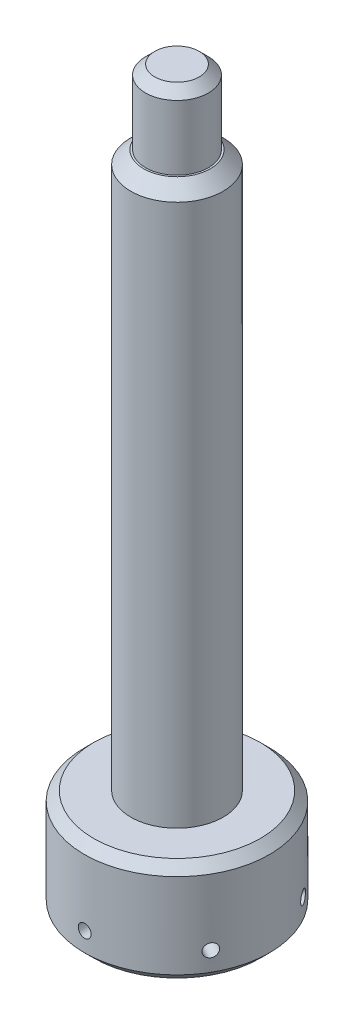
ISO-10303-21;
HEADER;
FILE_DESCRIPTION(('STEP AP214'),'2;1');
FILE_NAME('part.step','',(''),(''),'','','');
FILE_SCHEMA(('AUTOMOTIVE_DESIGN { 1 0 10303 214 1 1 1 1 }'));
ENDSEC;
DATA;
#1=APPLICATION_CONTEXT('core data for automotive mechanical design processes');
#2=APPLICATION_PROTOCOL_DEFINITION('international standard','automotive_design',2000,#1);
#3=PRODUCT_CONTEXT('',#1,'mechanical');
#4=PRODUCT('Part','Part','',(#3));
#5=PRODUCT_RELATED_PRODUCT_CATEGORY('part','',(#4));
#6=PRODUCT_DEFINITION_FORMATION('','',#4);
#7=PRODUCT_DEFINITION_CONTEXT('part definition',#1,'design');
#8=PRODUCT_DEFINITION('design','',#6,#7);
#9=PRODUCT_DEFINITION_SHAPE('','',#8);
#10=(LENGTH_UNIT() NAMED_UNIT(*) SI_UNIT(.MILLI.,.METRE.));
#11=(NAMED_UNIT(*) PLANE_ANGLE_UNIT() SI_UNIT($,.RADIAN.));
#12=(NAMED_UNIT(*) SI_UNIT($,.STERADIAN.) SOLID_ANGLE_UNIT());
#13=UNCERTAINTY_MEASURE_WITH_UNIT(LENGTH_MEASURE(1.E-05),#10,'distance_accuracy_value','');
#14=(GEOMETRIC_REPRESENTATION_CONTEXT(3) GLOBAL_UNCERTAINTY_ASSIGNED_CONTEXT((#13)) GLOBAL_UNIT_ASSIGNED_CONTEXT((#10,
#11,#12)) REPRESENTATION_CONTEXT('',''));
#15=CARTESIAN_POINT('',(0.,0.,0.));
#16=DIRECTION('',(0.,0.,1.));
#17=DIRECTION('',(1.,0.,0.));
#18=AXIS2_PLACEMENT_3D('',#15,#16,#17);
#19=CARTESIAN_POINT('',(0.,0.67987560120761,-6.35));
#20=DIRECTION('',(0.,0.,1.));
#21=DIRECTION('',(1.,0.,0.));
#22=AXIS2_PLACEMENT_3D('',#19,#20,#21);
#23=CYLINDRICAL_SURFACE('',#22,0.4445);
#24=CARTESIAN_POINT('',(0.4445,0.67987560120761,6.33442339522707));
#25=CARTESIAN_POINT('',(0.444498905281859,0.654940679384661,6.33442360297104));
#26=CARTESIAN_POINT('',(0.44239480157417,0.629988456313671,6.33457221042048));
#27=CARTESIAN_POINT('',(0.434031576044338,0.580773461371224,6.33515062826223));
#28=CARTESIAN_POINT('',(0.427767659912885,0.556511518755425,6.33558076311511));
#29=CARTESIAN_POINT('',(0.411266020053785,0.50939706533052,6.33667327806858));
#30=CARTESIAN_POINT('',(0.401030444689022,0.486543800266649,6.33733553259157));
#31=CARTESIAN_POINT('',(0.376879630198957,0.442885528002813,6.3388175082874));
#32=CARTESIAN_POINT('',(0.362965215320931,0.422080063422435,6.33963719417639));
#33=CARTESIAN_POINT('',(0.331823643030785,0.383063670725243,6.34134338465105));
#34=CARTESIAN_POINT('',(0.314591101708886,0.364857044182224,6.34222999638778));
#35=CARTESIAN_POINT('',(0.27731367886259,0.331592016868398,6.34396914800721));
#36=CARTESIAN_POINT('',(0.257268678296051,0.316533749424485,6.34482168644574));
#37=CARTESIAN_POINT('',(0.214910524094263,0.28997924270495,6.34639759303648));
#38=CARTESIAN_POINT('',(0.192595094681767,0.278486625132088,6.34712082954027));
#39=CARTESIAN_POINT('',(0.146345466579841,0.259412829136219,6.34835550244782));
#40=CARTESIAN_POINT('',(0.122411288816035,0.251831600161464,6.34886694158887));
#41=CARTESIAN_POINT('',(0.0736455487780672,0.240807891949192,6.34961965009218));
#42=CARTESIAN_POINT('',(0.0488155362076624,0.237358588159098,6.34986136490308));
#43=CARTESIAN_POINT('',(-0.00107213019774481,0.234675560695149,6.35004889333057));
#44=CARTESIAN_POINT('',(-0.0261297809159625,0.235441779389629,6.34999471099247));
#45=CARTESIAN_POINT('',(-0.0757151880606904,0.241162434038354,6.34959692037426));
#46=CARTESIAN_POINT('',(-0.100243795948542,0.246109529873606,6.34925381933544));
#47=CARTESIAN_POINT('',(-0.148121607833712,0.260040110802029,6.34831739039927));
#48=CARTESIAN_POINT('',(-0.171470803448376,0.269023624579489,6.34772406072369));
#49=CARTESIAN_POINT('',(-0.216350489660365,0.290780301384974,6.34635308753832));
#50=CARTESIAN_POINT('',(-0.237879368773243,0.303556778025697,6.34557528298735));
#51=CARTESIAN_POINT('',(-0.278489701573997,0.332534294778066,6.34392285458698));
#52=CARTESIAN_POINT('',(-0.297571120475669,0.348735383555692,6.34304822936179));
#53=CARTESIAN_POINT('',(-0.332787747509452,0.38414366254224,6.34129833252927));
#54=CARTESIAN_POINT('',(-0.348916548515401,0.403357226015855,6.34042306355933));
#55=CARTESIAN_POINT('',(-0.377720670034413,0.444222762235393,6.33877242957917));
#56=CARTESIAN_POINT('',(-0.390395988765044,0.465874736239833,6.33799706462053));
#57=CARTESIAN_POINT('',(-0.411932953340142,0.511006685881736,6.33663382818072));
#58=CARTESIAN_POINT('',(-0.420794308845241,0.534486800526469,6.33604597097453));
#59=CARTESIAN_POINT('',(-0.43444727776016,0.582606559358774,6.33512452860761));
#60=CARTESIAN_POINT('',(-0.439238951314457,0.607246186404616,6.33479093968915));
#61=CARTESIAN_POINT('',(-0.444608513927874,0.656929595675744,6.33441636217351));
#62=CARTESIAN_POINT('',(-0.445195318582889,0.681972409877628,6.33437475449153));
#63=CARTESIAN_POINT('',(-0.442161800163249,0.731800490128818,6.33458721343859));
#64=CARTESIAN_POINT('',(-0.438541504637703,0.756585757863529,6.33484127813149));
#65=CARTESIAN_POINT('',(-0.42720396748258,0.805169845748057,6.33561588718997));
#66=CARTESIAN_POINT('',(-0.419490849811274,0.828969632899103,6.33613616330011));
#67=CARTESIAN_POINT('',(-0.400190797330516,0.874937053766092,6.33738434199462));
#68=CARTESIAN_POINT('',(-0.388603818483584,0.897104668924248,6.33811224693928));
#69=CARTESIAN_POINT('',(-0.361862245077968,0.939219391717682,6.33969516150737));
#70=CARTESIAN_POINT('',(-0.346701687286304,0.959162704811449,6.34055038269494));
#71=CARTESIAN_POINT('',(-0.313251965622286,0.996224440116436,6.34229082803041));
#72=CARTESIAN_POINT('',(-0.294962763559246,1.01334282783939,6.34317605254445));
#73=CARTESIAN_POINT('',(-0.255736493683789,1.04429900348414,6.34487857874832));
#74=CARTESIAN_POINT('',(-0.234794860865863,1.05813101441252,6.3456957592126));
#75=CARTESIAN_POINT('',(-0.190881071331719,1.0820822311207,6.34716837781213));
#76=CARTESIAN_POINT('',(-0.167908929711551,1.0922014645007,6.34782381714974));
#77=CARTESIAN_POINT('',(-0.120607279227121,1.10842987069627,6.34889853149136));
#78=CARTESIAN_POINT('',(-0.0962790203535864,1.11454267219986,6.34931802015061));
#79=CARTESIAN_POINT('',(-0.0469384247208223,1.12259656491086,6.34987442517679));
#80=CARTESIAN_POINT('',(-0.0219260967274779,1.12453770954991,6.35001134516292));
#81=CARTESIAN_POINT('',(0.0280155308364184,1.1241926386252,6.34998719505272));
#82=CARTESIAN_POINT('',(0.0529448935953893,1.121915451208,6.34982676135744));
#83=CARTESIAN_POINT('',(0.102066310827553,1.1132171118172,6.34922720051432));
#84=CARTESIAN_POINT('',(0.126258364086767,1.10679595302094,6.34878807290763));
#85=CARTESIAN_POINT('',(0.173219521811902,1.08999407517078,6.34768045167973));
#86=CARTESIAN_POINT('',(0.195988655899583,1.07961343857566,6.34701196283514));
#87=CARTESIAN_POINT('',(0.239462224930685,1.05518842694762,6.34552058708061));
#88=CARTESIAN_POINT('',(0.26016670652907,1.04114413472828,6.34469770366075));
#89=CARTESIAN_POINT('',(0.298969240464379,1.00975683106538,6.34298794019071));
#90=CARTESIAN_POINT('',(0.317061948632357,0.992407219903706,6.34210093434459));
#91=CARTESIAN_POINT('',(0.350084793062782,0.954912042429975,6.34036393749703));
#92=CARTESIAN_POINT('',(0.36501415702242,0.934765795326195,6.33951395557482));
#93=CARTESIAN_POINT('',(0.391300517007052,0.89222101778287,6.33794588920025));
#94=CARTESIAN_POINT('',(0.402652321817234,0.86981927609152,6.33722799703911));
#95=CARTESIAN_POINT('',(0.421419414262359,0.82343871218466,6.33600780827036));
#96=CARTESIAN_POINT('',(0.428839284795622,0.799461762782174,6.33550526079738));
#97=CARTESIAN_POINT('',(0.437616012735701,0.759429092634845,6.33490356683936));
#98=CARTESIAN_POINT('',(0.440194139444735,0.743631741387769,6.33472431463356));
#99=CARTESIAN_POINT('',(0.443636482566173,0.711850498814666,6.33448416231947));
#100=CARTESIAN_POINT('',(0.444500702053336,0.695866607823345,6.33442326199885));
#101=CARTESIAN_POINT('',(0.4445,0.67987560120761,6.33442339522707));
#102=B_SPLINE_CURVE_WITH_KNOTS('',3,(#24,#25,#26,#27,#28,#29,#30,#31,#32,#33,#34,#35,#36,#37,
#38,#39,#40,#41,#42,#43,#44,#45,#46,#47,#48,#49,#50,#51,#52,#53,#54,#55,#56,#57,#58,#59,#60,#61,
#62,#63,#64,#65,#66,#67,#68,#69,#70,#71,#72,#73,#74,#75,#76,#77,#78,#79,#80,#81,#82,#83,#84,#85,
#86,#87,#88,#89,#90,#91,#92,#93,#94,#95,#96,#97,#98,#99,#100,#101),.UNSPECIFIED.,.T.,.F.,(4,2,2,
2,2,2,2,2,2,2,2,2,2,2,2,2,2,2,2,2,2,2,2,2,2,2,2,2,2,2,2,2,2,2,2,2,2,2,4),(0.,0.074746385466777,
0.149579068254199,0.224371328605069,0.299146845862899,0.374044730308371,0.448945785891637,
0.52392267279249,0.598898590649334,0.673750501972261,0.7486013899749,0.823321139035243,
0.898041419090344,0.972827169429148,1.04761398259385,1.12256120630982,1.19750846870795,
1.27246143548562,1.34741329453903,1.42220618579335,1.4969985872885,1.57171577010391,
1.6464338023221,1.72127741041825,1.79612193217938,1.87109706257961,1.94607163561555,
2.02097820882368,2.09588382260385,2.17062930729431,2.2453749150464,2.32011896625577,
2.39486132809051,2.46975452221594,2.5446659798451,2.61968564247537,2.69461767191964,
2.7425533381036,2.79048891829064),.UNSPECIFIED.);
#103=CARTESIAN_POINT('',(0.4445,0.67987560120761,6.33442339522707));
#104=VERTEX_POINT('',#103);
#105=EDGE_CURVE('E85',#104,#104,#102,.T.);
#106=ORIENTED_EDGE('',*,*,#105,.F.);
#107=EDGE_LOOP('',(#106));
#108=FACE_BOUND('',#107,.T.);
#109=CARTESIAN_POINT('',(0.,0.67987560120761,0.));
#110=DIRECTION('',(0.866025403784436,0.,0.500000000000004));
#111=DIRECTION('',(-0.500000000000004,0.,0.866025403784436));
#112=AXIS2_PLACEMENT_3D('',#109,#110,#111);
#113=ELLIPSE('',#112,0.888999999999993,0.4445);
#114=CARTESIAN_POINT('',(0.,0.23537560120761,0.));
#115=VERTEX_POINT('',#114);
#116=CARTESIAN_POINT('',(0.,1.12437560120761,0.));
#117=VERTEX_POINT('',#116);
#118=EDGE_CURVE('E251',#115,#117,#113,.F.);
#119=ORIENTED_EDGE('',*,*,#118,.T.);
#120=CARTESIAN_POINT('',(0.,0.67987560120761,0.));
#121=DIRECTION('',(-0.86602540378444,0.,0.499999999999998));
#122=DIRECTION('',(0.499999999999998,0.,0.86602540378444));
#123=AXIS2_PLACEMENT_3D('',#120,#121,#122);
#124=ELLIPSE('',#123,0.889000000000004,0.4445);
#125=EDGE_CURVE('E11',#117,#115,#124,.F.);
#126=ORIENTED_EDGE('',*,*,#125,.T.);
#127=EDGE_LOOP('',(#119,#126));
#128=FACE_BOUND('',#127,.T.);
#129=ADVANCED_FACE('F36',(#108,#128),#23,.F.);
#130=CARTESIAN_POINT('',(0.,-1.27,0.));
#131=DIRECTION('',(0.,-1.,0.));
#132=DIRECTION('',(0.,0.,-1.));
#133=AXIS2_PLACEMENT_3D('',#130,#131,#132);
#134=PLANE('',#133);
#135=DIRECTION('',(0.,0.,1.));
#136=VECTOR('',#135,1.);
#137=CARTESIAN_POINT('',(0.635000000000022,-1.27,-6.35));
#138=LINE('',#137,#136);
#139=CARTESIAN_POINT('',(0.635000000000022,-1.27,-5.67961266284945));
#140=VERTEX_POINT('',#139);
#141=CARTESIAN_POINT('',(0.635000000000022,-1.27,5.67961266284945));
#142=VERTEX_POINT('',#141);
#143=EDGE_CURVE('E80',#140,#142,#138,.T.);
#144=ORIENTED_EDGE('',*,*,#143,.F.);
#145=CARTESIAN_POINT('',(0.,-1.27,0.));
#146=DIRECTION('',(0.,-1.,0.));
#147=DIRECTION('',(0.,0.,-1.));
#148=AXIS2_PLACEMENT_3D('',#145,#146,#147);
#149=CIRCLE('',#148,5.71499999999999);
#150=EDGE_CURVE('E120',#140,#142,#149,.T.);
#151=ORIENTED_EDGE('',*,*,#150,.T.);
#152=EDGE_LOOP('',(#144,#151));
#153=FACE_BOUND('',#152,.T.);
#154=ADVANCED_FACE('F230',(#153),#134,.T.);
#155=CARTESIAN_POINT('',(0.,-1.27,0.));
#156=DIRECTION('',(0.,1.,0.));
#157=DIRECTION('',(0.,0.,1.));
#158=AXIS2_PLACEMENT_3D('',#155,#156,#157);
#159=CONICAL_SURFACE('',#158,5.71499999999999,0.785398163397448);
#160=CARTESIAN_POINT('',(0.635200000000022,-1.2702,5.67938905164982));
#161=CARTESIAN_POINT('',(0.583353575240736,-1.21835357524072,5.73735617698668));
#162=CARTESIAN_POINT('',(0.531203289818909,-1.16620328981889,5.79477801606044));
#163=CARTESIAN_POINT('',(0.426344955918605,-1.06134495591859,5.90856657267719));
#164=CARTESIAN_POINT('',(0.373637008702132,-1.00863700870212,5.96493347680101));
#165=CARTESIAN_POINT('',(0.267696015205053,-0.902696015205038,6.07666696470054));
#166=CARTESIAN_POINT('',(0.214462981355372,-0.849462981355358,6.13203357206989));
#167=CARTESIAN_POINT('',(0.107496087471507,-0.742496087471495,6.24181949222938));
#168=CARTESIAN_POINT('',(0.0537621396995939,-0.688762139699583,6.29623863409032));
#169=CARTESIAN_POINT('',(-0.000199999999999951,-0.63479999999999,6.35019999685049));
#170=B_SPLINE_CURVE_WITH_KNOTS('',3,(#160,#161,#162,#163,#164,#165,#166,#167,#168,#169),
.UNSPECIFIED.,.F.,.F.,(4,2,2,2,4),(0.,0.280400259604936,0.560750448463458,0.841094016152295,
1.12148764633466),.UNSPECIFIED.);
#171=CARTESIAN_POINT('',(0.,-0.63499999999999,6.35));
#172=VERTEX_POINT('',#171);
#173=EDGE_CURVE('E74',#142,#172,#170,.T.);
#174=ORIENTED_EDGE('',*,*,#173,.F.);
#175=ORIENTED_EDGE('',*,*,#150,.F.);
#176=CARTESIAN_POINT('',(-0.00020000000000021,-0.634799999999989,-6.35019999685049));
#177=CARTESIAN_POINT('',(0.0537621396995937,-0.688762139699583,-6.29623863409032));
#178=CARTESIAN_POINT('',(0.107496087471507,-0.742496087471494,-6.24181949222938));
#179=CARTESIAN_POINT('',(0.214462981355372,-0.849462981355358,-6.13203357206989));
#180=CARTESIAN_POINT('',(0.267696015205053,-0.902696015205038,-6.07666696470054));
#181=CARTESIAN_POINT('',(0.373637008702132,-1.00863700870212,-5.96493347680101));
#182=CARTESIAN_POINT('',(0.426344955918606,-1.06134495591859,-5.90856657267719));
#183=CARTESIAN_POINT('',(0.53120328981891,-1.16620328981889,-5.79477801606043));
#184=CARTESIAN_POINT('',(0.583353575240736,-1.21835357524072,-5.73735617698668));
#185=CARTESIAN_POINT('',(0.635200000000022,-1.2702,-5.67938905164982));
#186=B_SPLINE_CURVE_WITH_KNOTS('',3,(#176,#177,#178,#179,#180,#181,#182,#183,#184,#185),
.UNSPECIFIED.,.F.,.F.,(4,2,2,2,4),(0.,0.280393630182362,0.560737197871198,0.841087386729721,
1.12148764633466),.UNSPECIFIED.);
#187=CARTESIAN_POINT('',(0.,-0.63499999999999,-6.35));
#188=VERTEX_POINT('',#187);
#189=EDGE_CURVE('E105',#188,#140,#186,.T.);
#190=ORIENTED_EDGE('',*,*,#189,.F.);
#191=CARTESIAN_POINT('',(0.,-0.63499999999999,0.));
#192=DIRECTION('',(0.,-1.,0.));
#193=DIRECTION('',(0.,0.,-1.));
#194=AXIS2_PLACEMENT_3D('',#191,#192,#193);
#195=CIRCLE('',#194,6.35);
#196=EDGE_CURVE('E108',#172,#188,#195,.F.);
#197=ORIENTED_EDGE('',*,*,#196,.F.);
#198=EDGE_LOOP('',(#174,#175,#190,#197));
#199=FACE_BOUND('',#198,.T.);
#200=ADVANCED_FACE('F109',(#199),#159,.T.);
#201=CARTESIAN_POINT('',(0.,43.942,0.));
#202=DIRECTION('',(0.,1.,0.));
#203=DIRECTION('',(0.,0.,1.));
#204=AXIS2_PLACEMENT_3D('',#201,#202,#203);
#205=PLANE('',#204);
#206=CARTESIAN_POINT('',(0.,43.942,0.));
#207=DIRECTION('',(0.,1.,0.));
#208=DIRECTION('',(0.,0.,1.));
#209=AXIS2_PLACEMENT_3D('',#206,#207,#208);
#210=CIRCLE('',#209,2.28600000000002);
#211=CARTESIAN_POINT('',(0.,43.942,-2.28600000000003));
#212=VERTEX_POINT('',#211);
#213=EDGE_CURVE('E122',#212,#212,#210,.T.);
#214=ORIENTED_EDGE('',*,*,#213,.T.);
#215=EDGE_LOOP('',(#214));
#216=FACE_BOUND('',#215,.T.);
#217=CARTESIAN_POINT('',(0.,43.942,0.));
#218=DIRECTION('',(0.,1.,0.));
#219=DIRECTION('',(0.,0.,1.));
#220=AXIS2_PLACEMENT_3D('',#217,#218,#219);
#221=CIRCLE('',#220,2.159);
#222=CARTESIAN_POINT('',(0.,43.942,2.159));
#223=VERTEX_POINT('',#222);
#224=EDGE_CURVE('E279',#223,#223,#221,.T.);
#225=ORIENTED_EDGE('',*,*,#224,.F.);
#226=EDGE_LOOP('',(#225));
#227=FACE_BOUND('',#226,.T.);
#228=ADVANCED_FACE('F300',(#216,#227),#205,.T.);
#229=CARTESIAN_POINT('',(0.,5.842,0.));
#230=DIRECTION('',(0.,1.,0.));
#231=DIRECTION('',(0.,0.,1.));
#232=AXIS2_PLACEMENT_3D('',#229,#230,#231);
#233=PLANE('',#232);
#234=CARTESIAN_POINT('',(0.,5.842,0.));
#235=DIRECTION('',(0.,1.,0.));
#236=DIRECTION('',(0.,0.,1.));
#237=AXIS2_PLACEMENT_3D('',#234,#235,#236);
#238=CIRCLE('',#237,5.71499999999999);
#239=CARTESIAN_POINT('',(0.,5.842,5.71499999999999));
#240=VERTEX_POINT('',#239);
#241=EDGE_CURVE('E111',#240,#240,#238,.T.);
#242=ORIENTED_EDGE('',*,*,#241,.T.);
#243=EDGE_LOOP('',(#242));
#244=FACE_BOUND('',#243,.T.);
#245=CARTESIAN_POINT('',(0.,5.842,0.));
#246=DIRECTION('',(0.,1.,0.));
#247=DIRECTION('',(0.,0.,1.));
#248=AXIS2_PLACEMENT_3D('',#245,#246,#247);
#249=CIRCLE('',#248,3.175);
#250=CARTESIAN_POINT('',(0.,5.842,-3.175));
#251=VERTEX_POINT('',#250);
#252=EDGE_CURVE('E277',#251,#251,#249,.T.);
#253=ORIENTED_EDGE('',*,*,#252,.F.);
#254=EDGE_LOOP('',(#253));
#255=FACE_BOUND('',#254,.T.);
#256=ADVANCED_FACE('F181',(#244,#255),#233,.T.);
#257=CARTESIAN_POINT('',(0.,4.572,0.));
#258=DIRECTION('',(0.,-1.,0.));
#259=DIRECTION('',(0.,0.,-1.));
#260=AXIS2_PLACEMENT_3D('',#257,#258,#259);
#261=CYLINDRICAL_SURFACE('',#260,6.35);
#262=CARTESIAN_POINT('',(5.2635215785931,0.67987560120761,3.55215998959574));
#263=CARTESIAN_POINT('',(5.26352230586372,0.704810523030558,3.552159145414));
#264=CARTESIAN_POINT('',(5.26470305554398,0.729762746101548,3.55041124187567));
#265=CARTESIAN_POINT('',(5.26938559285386,0.778977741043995,3.54345768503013));
#266=CARTESIAN_POINT('',(5.27289005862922,0.803239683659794,3.53824804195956));
#267=CARTESIAN_POINT('',(5.2820870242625,0.850354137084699,3.52450346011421));
#268=CARTESIAN_POINT('',(5.28777834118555,0.87320740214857,3.51597031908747));
#269=CARTESIAN_POINT('',(5.30113717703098,0.916865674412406,3.49579608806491));
#270=CARTESIAN_POINT('',(5.30880425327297,0.937671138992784,3.48415569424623));
#271=CARTESIAN_POINT('',(5.3258526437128,0.976687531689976,3.45803939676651));
#272=CARTESIAN_POINT('',(5.33523674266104,0.994894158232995,3.44355888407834));
#273=CARTESIAN_POINT('',(5.35538160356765,1.02815918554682,3.41214526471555));
#274=CARTESIAN_POINT('',(5.3661424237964,1.04321745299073,3.39521205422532));
#275=CARTESIAN_POINT('',(5.38868627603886,1.06977195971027,3.35931676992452));
#276=CARTESIAN_POINT('',(5.40047033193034,1.08126457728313,3.34035265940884));
#277=CARTESIAN_POINT('',(5.4246644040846,1.100338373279,3.30091664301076));
#278=CARTESIAN_POINT('',(5.43707441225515,1.10791960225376,3.28044475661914));
#279=CARTESIAN_POINT('',(5.46210914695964,1.11894331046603,3.23858874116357));
#280=CARTESIAN_POINT('',(5.47473348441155,1.12239261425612,3.21720617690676));
#281=CARTESIAN_POINT('',(5.4998397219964,1.12507564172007,3.1740959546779));
#282=CARTESIAN_POINT('',(5.51232162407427,1.12430942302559,3.15236830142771));
#283=CARTESIAN_POINT('',(5.53676983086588,1.11858876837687,3.10922718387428));
#284=CARTESIAN_POINT('',(5.54873700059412,1.11364167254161,3.08781323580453));
#285=CARTESIAN_POINT('',(5.57186493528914,1.09971109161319,3.04588161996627));
#286=CARTESIAN_POINT('',(5.5830256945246,1.09072757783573,3.02536395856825));
#287=CARTESIAN_POINT('',(5.60427824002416,1.06897090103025,2.98581152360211));
#288=CARTESIAN_POINT('',(5.61436908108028,1.05619442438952,2.96677806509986));
#289=CARTESIAN_POINT('',(5.633243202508,1.02721690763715,2.93078227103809));
#290=CARTESIAN_POINT('',(5.64202646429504,1.01101581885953,2.91381996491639));
#291=CARTESIAN_POINT('',(5.65811932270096,0.97560753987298,2.88244652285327));
#292=CARTESIAN_POINT('',(5.66542571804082,0.956393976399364,2.86804093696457));
#293=CARTESIAN_POINT('',(5.67839828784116,0.915528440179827,2.84227051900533));
#294=CARTESIAN_POINT('',(5.68406446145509,0.893876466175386,2.83090568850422));
#295=CARTESIAN_POINT('',(5.6936523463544,0.848744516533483,2.81157251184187));
#296=CARTESIAN_POINT('',(5.69757392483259,0.82526440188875,2.8036044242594));
#297=CARTESIAN_POINT('',(5.70360241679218,0.777144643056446,2.79131988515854));
#298=CARTESIAN_POINT('',(5.70570935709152,0.752505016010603,2.78700337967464));
#299=CARTESIAN_POINT('',(5.70806974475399,0.702821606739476,2.78216591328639));
#300=CARTESIAN_POINT('',(5.70832711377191,0.677778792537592,2.7816369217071));
#301=CARTESIAN_POINT('',(5.70699434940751,0.627950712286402,2.78437025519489));
#302=CARTESIAN_POINT('',(5.70540422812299,0.603165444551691,2.78763255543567));
#303=CARTESIAN_POINT('',(5.70040629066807,0.554581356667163,2.79783845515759));
#304=CARTESIAN_POINT('',(5.69700030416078,0.530781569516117,2.80477834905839));
#305=CARTESIAN_POINT('',(5.68843123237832,0.484814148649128,2.82211677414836));
#306=CARTESIAN_POINT('',(5.68326812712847,0.462646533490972,2.83251534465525));
#307=CARTESIAN_POINT('',(5.67126818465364,0.420531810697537,2.85646568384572));
#308=CARTESIAN_POINT('',(5.6644285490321,0.40058849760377,2.87002272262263));
#309=CARTESIAN_POINT('',(5.64921095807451,0.363526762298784,2.89986125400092));
#310=CARTESIAN_POINT('',(5.6408329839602,0.346408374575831,2.91614277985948));
#311=CARTESIAN_POINT('',(5.62269427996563,0.315452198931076,2.95096498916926));
#312=CARTESIAN_POINT('',(5.6129311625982,0.301620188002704,2.96950956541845));
#313=CARTESIAN_POINT('',(5.59224959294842,0.277668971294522,3.00827633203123));
#314=CARTESIAN_POINT('',(5.58133114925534,0.267549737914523,3.02849850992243));
#315=CARTESIAN_POINT('',(5.55861105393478,0.251321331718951,3.07000029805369));
#316=CARTESIAN_POINT('',(5.54681021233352,0.245208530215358,3.09127893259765));
#317=CARTESIAN_POINT('',(5.5226217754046,0.237154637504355,3.13428734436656));
#318=CARTESIAN_POINT('',(5.51023418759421,0.235213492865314,3.15601711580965));
#319=CARTESIAN_POINT('',(5.48524245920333,0.235558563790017,3.19925575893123));
#320=CARTESIAN_POINT('',(5.4726388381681,0.237835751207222,3.22076500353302));
#321=CARTESIAN_POINT('',(5.44755889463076,0.246534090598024,3.2630056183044));
#322=CARTESIAN_POINT('',(5.43508257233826,0.252955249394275,3.28373698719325));
#323=CARTESIAN_POINT('',(5.41064276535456,0.26975712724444,3.32385273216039));
#324=CARTESIAN_POINT('',(5.39867926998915,0.280137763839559,3.3432371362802));
#325=CARTESIAN_POINT('',(5.3756509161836,0.304562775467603,3.38014066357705));
#326=CARTESIAN_POINT('',(5.36458603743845,0.318607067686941,3.39765982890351));
#327=CARTESIAN_POINT('',(5.34370407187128,0.349994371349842,3.43040892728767));
#328=CARTESIAN_POINT('',(5.33388954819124,0.367343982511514,3.44563416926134));
#329=CARTESIAN_POINT('',(5.31587384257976,0.404839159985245,3.47336429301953));
#330=CARTESIAN_POINT('',(5.30767305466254,0.424985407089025,3.48586851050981));
#331=CARTESIAN_POINT('',(5.29317188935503,0.46753018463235,3.50784913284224));
#332=CARTESIAN_POINT('',(5.28687427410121,0.489931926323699,3.51732113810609));
#333=CARTESIAN_POINT('',(5.2764340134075,0.536312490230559,3.53296382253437));
#334=CARTESIAN_POINT('',(5.27228885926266,0.560289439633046,3.53913834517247));
#335=CARTESIAN_POINT('',(5.26737941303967,0.600322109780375,3.54643836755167));
#336=CARTESIAN_POINT('',(5.26593511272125,0.616119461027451,3.54858146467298));
#337=CARTESIAN_POINT('',(5.26400596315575,0.647900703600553,3.55144254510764));
#338=CARTESIAN_POINT('',(5.26352111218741,0.663884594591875,3.55216053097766));
#339=CARTESIAN_POINT('',(5.2635215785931,0.67987560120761,3.55215998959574));
#340=B_SPLINE_CURVE_WITH_KNOTS('',3,(#262,#263,#264,#265,#266,#267,#268,#269,#270,#271,#272,
#273,#274,#275,#276,#277,#278,#279,#280,#281,#282,#283,#284,#285,#286,#287,#288,#289,#290,#291,
#292,#293,#294,#295,#296,#297,#298,#299,#300,#301,#302,#303,#304,#305,#306,#307,#308,#309,#310,
#311,#312,#313,#314,#315,#316,#317,#318,#319,#320,#321,#322,#323,#324,#325,#326,#327,#328,#329,
#330,#331,#332,#333,#334,#335,#336,#337,#338,#339),.UNSPECIFIED.,.T.,.F.,(4,2,2,2,2,2,2,2,2,2,2,
2,2,2,2,2,2,2,2,2,2,2,2,2,2,2,2,2,2,2,2,2,2,2,2,2,2,2,4),(0.,0.074746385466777,
0.149579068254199,0.224371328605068,0.299146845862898,0.374044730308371,0.448945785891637,
0.523922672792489,0.598898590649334,0.673750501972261,0.7486013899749,0.823321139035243,
0.898041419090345,0.972827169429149,1.04761398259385,1.12256120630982,1.19750846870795,
1.27246143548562,1.34741329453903,1.42220618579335,1.4969985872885,1.57171577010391,
1.6464338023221,1.72127741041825,1.79612193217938,1.87109706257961,1.94607163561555,
2.02097820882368,2.09588382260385,2.17062930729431,2.2453749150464,2.32011896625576,
2.39486132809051,2.46975452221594,2.5446659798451,2.61968564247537,2.69461767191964,
2.7425533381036,2.79048891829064),.UNSPECIFIED.);
#341=CARTESIAN_POINT('',(5.2635215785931,0.67987560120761,3.55215998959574));
#342=VERTEX_POINT('',#341);
#343=EDGE_CURVE('E95',#342,#342,#340,.T.);
#344=ORIENTED_EDGE('',*,*,#343,.T.);
#345=EDGE_LOOP('',(#344));
#346=FACE_BOUND('',#345,.T.);
#347=CARTESIAN_POINT('',(5.26352157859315,0.67987560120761,-3.55215998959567));
#348=CARTESIAN_POINT('',(5.26352230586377,0.654940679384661,-3.55215914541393));
#349=CARTESIAN_POINT('',(5.26470305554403,0.629988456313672,-3.5504112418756));
#350=CARTESIAN_POINT('',(5.26938559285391,0.580773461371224,-3.54345768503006));
#351=CARTESIAN_POINT('',(5.27289005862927,0.556511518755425,-3.53824804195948));
#352=CARTESIAN_POINT('',(5.28208702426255,0.509397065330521,-3.52450346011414));
#353=CARTESIAN_POINT('',(5.2877783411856,0.486543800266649,-3.5159703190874));
#354=CARTESIAN_POINT('',(5.30113717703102,0.442885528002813,-3.49579608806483));
#355=CARTESIAN_POINT('',(5.30880425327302,0.422080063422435,-3.48415569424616));
#356=CARTESIAN_POINT('',(5.32585264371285,0.383063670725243,-3.45803939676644));
#357=CARTESIAN_POINT('',(5.33523674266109,0.364857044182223,-3.44355888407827));
#358=CARTESIAN_POINT('',(5.3553816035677,0.331592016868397,-3.41214526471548));
#359=CARTESIAN_POINT('',(5.36614242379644,0.316533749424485,-3.39521205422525));
#360=CARTESIAN_POINT('',(5.38868627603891,0.28997924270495,-3.35931676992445));
#361=CARTESIAN_POINT('',(5.40047033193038,0.278486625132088,-3.34035265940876));
#362=CARTESIAN_POINT('',(5.42466440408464,0.259412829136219,-3.30091664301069));
#363=CARTESIAN_POINT('',(5.43707441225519,0.251831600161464,-3.28044475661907));
#364=CARTESIAN_POINT('',(5.46210914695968,0.240807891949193,-3.23858874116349));
#365=CARTESIAN_POINT('',(5.47473348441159,0.237358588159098,-3.21720617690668));
#366=CARTESIAN_POINT('',(5.49983972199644,0.234675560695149,-3.17409595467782));
#367=CARTESIAN_POINT('',(5.51232162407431,0.235441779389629,-3.15236830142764));
#368=CARTESIAN_POINT('',(5.53676983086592,0.241162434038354,-3.10922718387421));
#369=CARTESIAN_POINT('',(5.54873700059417,0.246109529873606,-3.08781323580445));
#370=CARTESIAN_POINT('',(5.57186493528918,0.260040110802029,-3.04588161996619));
#371=CARTESIAN_POINT('',(5.58302569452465,0.269023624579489,-3.02536395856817));
#372=CARTESIAN_POINT('',(5.6042782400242,0.290780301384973,-2.98581152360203));
#373=CARTESIAN_POINT('',(5.61436908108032,0.303556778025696,-2.96677806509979));
#374=CARTESIAN_POINT('',(5.63324320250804,0.332534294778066,-2.93078227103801));
#375=CARTESIAN_POINT('',(5.64202646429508,0.348735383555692,-2.91381996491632));
#376=CARTESIAN_POINT('',(5.658119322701,0.38414366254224,-2.8824465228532));
#377=CARTESIAN_POINT('',(5.66542571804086,0.403357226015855,-2.86804093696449));
#378=CARTESIAN_POINT('',(5.6783982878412,0.444222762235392,-2.84227051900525));
#379=CARTESIAN_POINT('',(5.68406446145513,0.465874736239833,-2.83090568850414));
#380=CARTESIAN_POINT('',(5.69365234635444,0.511006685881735,-2.81157251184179));
#381=CARTESIAN_POINT('',(5.69757392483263,0.534486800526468,-2.80360442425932));
#382=CARTESIAN_POINT('',(5.70360241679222,0.582606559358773,-2.79131988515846));
#383=CARTESIAN_POINT('',(5.70570935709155,0.607246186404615,-2.78700337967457));
#384=CARTESIAN_POINT('',(5.70806974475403,0.656929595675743,-2.78216591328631));
#385=CARTESIAN_POINT('',(5.70832711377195,0.681972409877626,-2.78163692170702));
#386=CARTESIAN_POINT('',(5.70699434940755,0.731800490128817,-2.78437025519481));
#387=CARTESIAN_POINT('',(5.70540422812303,0.756585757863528,-2.78763255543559));
#388=CARTESIAN_POINT('',(5.70040629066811,0.805169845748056,-2.79783845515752));
#389=CARTESIAN_POINT('',(5.69700030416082,0.828969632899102,-2.80477834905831));
#390=CARTESIAN_POINT('',(5.68843123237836,0.874937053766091,-2.82211677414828));
#391=CARTESIAN_POINT('',(5.68326812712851,0.897104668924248,-2.83251534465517));
#392=CARTESIAN_POINT('',(5.67126818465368,0.939219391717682,-2.85646568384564));
#393=CARTESIAN_POINT('',(5.66442854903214,0.959162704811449,-2.87002272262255));
#394=CARTESIAN_POINT('',(5.64921095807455,0.996224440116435,-2.89986125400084));
#395=CARTESIAN_POINT('',(5.64083298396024,1.01334282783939,-2.9161427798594));
#396=CARTESIAN_POINT('',(5.62269427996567,1.04429900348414,-2.95096498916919));
#397=CARTESIAN_POINT('',(5.61293116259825,1.05813101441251,-2.96950956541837));
#398=CARTESIAN_POINT('',(5.59224959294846,1.0820822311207,-3.00827633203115));
#399=CARTESIAN_POINT('',(5.58133114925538,1.0922014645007,-3.02849850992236));
#400=CARTESIAN_POINT('',(5.55861105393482,1.10842987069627,-3.07000029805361));
#401=CARTESIAN_POINT('',(5.54681021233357,1.11454267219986,-3.09127893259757));
#402=CARTESIAN_POINT('',(5.52262177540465,1.12259656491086,-3.13428734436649));
#403=CARTESIAN_POINT('',(5.51023418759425,1.12453770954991,-3.15601711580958));
#404=CARTESIAN_POINT('',(5.48524245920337,1.1241926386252,-3.19925575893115));
#405=CARTESIAN_POINT('',(5.47263883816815,1.121915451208,-3.22076500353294));
#406=CARTESIAN_POINT('',(5.4475588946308,1.1132171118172,-3.26300561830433));
#407=CARTESIAN_POINT('',(5.43508257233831,1.10679595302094,-3.28373698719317));
#408=CARTESIAN_POINT('',(5.41064276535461,1.08999407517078,-3.32385273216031));
#409=CARTESIAN_POINT('',(5.3986792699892,1.07961343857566,-3.34323713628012));
#410=CARTESIAN_POINT('',(5.37565091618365,1.05518842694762,-3.38014066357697));
#411=CARTESIAN_POINT('',(5.3645860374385,1.04114413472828,-3.39765982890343));
#412=CARTESIAN_POINT('',(5.34370407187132,1.00975683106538,-3.43040892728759));
#413=CARTESIAN_POINT('',(5.33388954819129,0.992407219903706,-3.44563416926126));
#414=CARTESIAN_POINT('',(5.3158738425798,0.954912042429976,-3.47336429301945));
#415=CARTESIAN_POINT('',(5.30767305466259,0.934765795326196,-3.48586851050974));
#416=CARTESIAN_POINT('',(5.29317188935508,0.89222101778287,-3.50784913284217));
#417=CARTESIAN_POINT('',(5.28687427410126,0.869819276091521,-3.51732113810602));
#418=CARTESIAN_POINT('',(5.27643401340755,0.823438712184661,-3.53296382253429));
#419=CARTESIAN_POINT('',(5.27228885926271,0.799461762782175,-3.5391383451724));
#420=CARTESIAN_POINT('',(5.26737941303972,0.759429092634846,-3.5464383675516));
#421=CARTESIAN_POINT('',(5.2659351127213,0.74363174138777,-3.5485814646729));
#422=CARTESIAN_POINT('',(5.2640059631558,0.711850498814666,-3.55144254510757));
#423=CARTESIAN_POINT('',(5.26352111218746,0.695866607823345,-3.55216053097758));
#424=CARTESIAN_POINT('',(5.26352157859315,0.67987560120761,-3.55215998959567));
#425=B_SPLINE_CURVE_WITH_KNOTS('',3,(#347,#348,#349,#350,#351,#352,#353,#354,#355,#356,#357,
#358,#359,#360,#361,#362,#363,#364,#365,#366,#367,#368,#369,#370,#371,#372,#373,#374,#375,#376,
#377,#378,#379,#380,#381,#382,#383,#384,#385,#386,#387,#388,#389,#390,#391,#392,#393,#394,#395,
#396,#397,#398,#399,#400,#401,#402,#403,#404,#405,#406,#407,#408,#409,#410,#411,#412,#413,#414,
#415,#416,#417,#418,#419,#420,#421,#422,#423,#424),.UNSPECIFIED.,.T.,.F.,(4,2,2,2,2,2,2,2,2,2,2,
2,2,2,2,2,2,2,2,2,2,2,2,2,2,2,2,2,2,2,2,2,2,2,2,2,2,2,4),(0.,0.0747463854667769,
0.149579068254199,0.224371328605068,0.299146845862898,0.374044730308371,0.448945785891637,
0.52392267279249,0.598898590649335,0.673750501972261,0.7486013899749,0.823321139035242,
0.898041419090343,0.972827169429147,1.04761398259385,1.12256120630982,1.19750846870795,
1.27246143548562,1.34741329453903,1.42220618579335,1.4969985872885,1.57171577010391,
1.6464338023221,1.72127741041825,1.79612193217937,1.87109706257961,1.94607163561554,
2.02097820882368,2.09588382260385,2.17062930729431,2.2453749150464,2.32011896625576,
2.39486132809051,2.46975452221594,2.5446659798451,2.61968564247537,2.69461767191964,
2.7425533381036,2.79048891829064),.UNSPECIFIED.);
#426=CARTESIAN_POINT('',(5.26352157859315,0.67987560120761,-3.55215998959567));
#427=VERTEX_POINT('',#426);
#428=EDGE_CURVE('E204',#427,#427,#425,.T.);
#429=ORIENTED_EDGE('',*,*,#428,.T.);
#430=EDGE_LOOP('',(#429));
#431=FACE_BOUND('',#430,.T.);
#432=CARTESIAN_POINT('',(-5.7080215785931,0.67987560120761,-2.78226340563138));
#433=CARTESIAN_POINT('',(-5.70802121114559,0.654940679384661,-2.78226445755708));
#434=CARTESIAN_POINT('',(-5.70709785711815,0.629988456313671,-2.78416096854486));
#435=CARTESIAN_POINT('',(-5.7034171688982,0.580773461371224,-2.79169294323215));
#436=CARTESIAN_POINT('',(-5.70065771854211,0.556511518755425,-2.7973327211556));
#437=CARTESIAN_POINT('',(-5.69335304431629,0.50939706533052,-2.81216981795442));
#438=CARTESIAN_POINT('',(-5.68880878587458,0.486543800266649,-2.82136521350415));
#439=CARTESIAN_POINT('',(-5.67801680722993,0.442885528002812,-2.84302142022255));
#440=CARTESIAN_POINT('',(-5.6717694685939,0.422080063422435,-2.8554814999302));
#441=CARTESIAN_POINT('',(-5.65767628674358,0.383063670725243,-2.88330398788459));
#442=CARTESIAN_POINT('',(-5.64982784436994,0.364857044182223,-2.89867111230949));
#443=CARTESIAN_POINT('',(-5.63269528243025,0.331592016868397,-2.93182388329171));
#444=CARTESIAN_POINT('',(-5.62341110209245,0.316533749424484,-2.94960963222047));
#445=CARTESIAN_POINT('',(-5.60359680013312,0.28997924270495,-2.987080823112));
#446=CARTESIAN_POINT('',(-5.5930654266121,0.278486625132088,-3.00676817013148));
#447=CARTESIAN_POINT('',(-5.57100987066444,0.259412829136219,-3.0474388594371));
#448=CARTESIAN_POINT('',(-5.55948570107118,0.251831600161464,-3.06842218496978));
#449=CARTESIAN_POINT('',(-5.53575469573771,0.240807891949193,-3.11103090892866));
#450=CARTESIAN_POINT('',(-5.52354902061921,0.237358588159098,-3.13265518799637));
#451=CARTESIAN_POINT('',(-5.49876759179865,0.234675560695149,-3.17595293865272));
#452=CARTESIAN_POINT('',(-5.48619184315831,0.235441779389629,-3.1976264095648));
#453=CARTESIAN_POINT('',(-5.46105464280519,0.241162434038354,-3.24036973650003));
#454=CARTESIAN_POINT('',(-5.44849320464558,0.246109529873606,-3.26144058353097));
#455=CARTESIAN_POINT('',(-5.42374332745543,0.26004011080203,-3.30243577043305));
#456=CARTESIAN_POINT('',(-5.41155489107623,0.269023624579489,-3.32236010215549));
#457=CARTESIAN_POINT('',(-5.3879277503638,0.290780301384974,-3.36054156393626));
#458=CARTESIAN_POINT('',(-5.37648971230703,0.303556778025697,-3.37879721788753));
#459=CARTESIAN_POINT('',(-5.35475350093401,0.332534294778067,-3.41314058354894));
#460=CARTESIAN_POINT('',(-5.34445534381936,0.348735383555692,-3.42922826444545));
#461=CARTESIAN_POINT('',(-5.32533157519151,0.38414366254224,-3.45885180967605));
#462=CARTESIAN_POINT('',(-5.31650916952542,0.403357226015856,-3.47238212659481));
#463=CARTESIAN_POINT('',(-5.30067761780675,0.444222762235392,-3.49650191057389));
#464=CARTESIAN_POINT('',(-5.29366847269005,0.465874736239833,-3.50709137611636));
#465=CARTESIAN_POINT('',(-5.28171939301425,0.511006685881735,-3.5250613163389));
#466=CARTESIAN_POINT('',(-5.27677961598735,0.534486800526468,-3.53244154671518));
#467=CARTESIAN_POINT('',(-5.26915513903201,0.582606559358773,-3.54380464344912));
#468=CARTESIAN_POINT('',(-5.26647040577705,0.607246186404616,-3.54778756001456));
#469=CARTESIAN_POINT('',(-5.26346123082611,0.656929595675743,-3.55225044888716));
#470=CARTESIAN_POINT('',(-5.26313179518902,0.681972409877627,-3.55273783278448));
#471=CARTESIAN_POINT('',(-5.26483254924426,0.731800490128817,-3.55021695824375));
#472=CARTESIAN_POINT('',(-5.26686272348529,0.756585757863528,-3.54720872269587));
#473=CARTESIAN_POINT('',(-5.27320232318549,0.805169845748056,-3.53777743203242));
#474=CARTESIAN_POINT('',(-5.2775094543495,0.828969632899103,-3.53135781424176));
#475=CARTESIAN_POINT('',(-5.2882404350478,0.874937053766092,-3.51526756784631));
#476=CARTESIAN_POINT('',(-5.29466430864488,0.897104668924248,-3.50559690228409));
#477=CARTESIAN_POINT('',(-5.30940593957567,0.939219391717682,-3.4832294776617));
#478=CARTESIAN_POINT('',(-5.3177268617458,0.959162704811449,-3.47052766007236));
#479=CARTESIAN_POINT('',(-5.33595899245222,0.996224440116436,-3.44242957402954));
#480=CARTESIAN_POINT('',(-5.34587022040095,1.01334282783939,-3.42703327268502));
#481=CARTESIAN_POINT('',(-5.36695778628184,1.04429900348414,-3.3939135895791));
#482=CARTESIAN_POINT('',(-5.37813630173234,1.05813101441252,-3.37618619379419));
#483=CARTESIAN_POINT('',(-5.4013685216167,1.0820822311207,-3.33889204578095));
#484=CARTESIAN_POINT('',(-5.41342221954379,1.0922014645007,-3.31932530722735));
#485=CARTESIAN_POINT('',(-5.43800377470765,1.10842987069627,-3.27889823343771));
#486=CARTESIAN_POINT('',(-5.45053119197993,1.11454267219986,-3.25803908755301));
#487=CARTESIAN_POINT('',(-5.47568335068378,1.12259656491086,-3.21558708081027));
#488=CARTESIAN_POINT('',(-5.48830809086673,1.12453770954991,-3.19399422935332));
#489=CARTESIAN_POINT('',(-5.51325799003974,1.1241926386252,-3.15073143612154));
#490=CARTESIAN_POINT('',(-5.52558373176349,1.121915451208,-3.12906175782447));
#491=CARTESIAN_POINT('',(-5.54962520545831,1.1132171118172,-3.08622158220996));
#492=CARTESIAN_POINT('',(-5.56134093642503,1.10679595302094,-3.06505108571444));
#493=CARTESIAN_POINT('',(-5.58386228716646,1.08999407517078,-3.02382771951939));
#494=CARTESIAN_POINT('',(-5.59466792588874,1.07961343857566,-3.00377482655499));
#495=CARTESIAN_POINT('',(-5.61511314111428,1.05518842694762,-2.96537992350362));
#496=CARTESIAN_POINT('',(-5.62475274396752,1.04114413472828,-2.9470378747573));
#497=CARTESIAN_POINT('',(-5.64267331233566,1.00975683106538,-2.91257901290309));
#498=CARTESIAN_POINT('',(-5.6509514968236,0.992407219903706,-2.8964667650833));
#499=CARTESIAN_POINT('',(-5.66595863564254,0.954912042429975,-2.86699964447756));
#500=CARTESIAN_POINT('',(-5.67268721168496,0.934765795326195,-2.85364544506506));
#501=CARTESIAN_POINT('',(-5.68447240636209,0.89222101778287,-2.83009675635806));
#502=CARTESIAN_POINT('',(-5.68952659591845,0.869819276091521,-2.81990685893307));
#503=CARTESIAN_POINT('',(-5.69785342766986,0.823438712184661,-2.80304398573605));
#504=CARTESIAN_POINT('',(-5.70112814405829,0.799461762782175,-2.79636691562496));
#505=CARTESIAN_POINT('',(-5.70499542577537,0.759429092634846,-2.78846519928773));
#506=CARTESIAN_POINT('',(-5.70612925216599,0.743631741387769,-2.78614284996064));
#507=CARTESIAN_POINT('',(-5.70764244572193,0.711850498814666,-2.78304161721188));
#508=CARTESIAN_POINT('',(-5.70802181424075,0.695866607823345,-2.78226273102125));
#509=CARTESIAN_POINT('',(-5.7080215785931,0.67987560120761,-2.78226340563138));
#510=B_SPLINE_CURVE_WITH_KNOTS('',3,(#432,#433,#434,#435,#436,#437,#438,#439,#440,#441,#442,
#443,#444,#445,#446,#447,#448,#449,#450,#451,#452,#453,#454,#455,#456,#457,#458,#459,#460,#461,
#462,#463,#464,#465,#466,#467,#468,#469,#470,#471,#472,#473,#474,#475,#476,#477,#478,#479,#480,
#481,#482,#483,#484,#485,#486,#487,#488,#489,#490,#491,#492,#493,#494,#495,#496,#497,#498,#499,
#500,#501,#502,#503,#504,#505,#506,#507,#508,#509),.UNSPECIFIED.,.T.,.F.,(4,2,2,2,2,2,2,2,2,2,2,
2,2,2,2,2,2,2,2,2,2,2,2,2,2,2,2,2,2,2,2,2,2,2,2,2,2,2,4),(0.,0.074746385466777,
0.149579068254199,0.224371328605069,0.299146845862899,0.374044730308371,0.448945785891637,
0.523922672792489,0.598898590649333,0.67375050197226,0.748601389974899,0.823321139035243,
0.898041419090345,0.972827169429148,1.04761398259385,1.12256120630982,1.19750846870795,
1.27246143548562,1.34741329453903,1.42220618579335,1.4969985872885,1.57171577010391,
1.6464338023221,1.72127741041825,1.79612193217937,1.87109706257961,1.94607163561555,
2.02097820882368,2.09588382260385,2.17062930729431,2.2453749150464,2.32011896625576,
2.39486132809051,2.46975452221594,2.5446659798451,2.61968564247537,2.69461767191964,
2.7425533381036,2.79048891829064),.UNSPECIFIED.);
#511=CARTESIAN_POINT('',(-5.7080215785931,0.67987560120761,-2.78226340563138));
#512=VERTEX_POINT('',#511);
#513=EDGE_CURVE('E199',#512,#512,#510,.T.);
#514=ORIENTED_EDGE('',*,*,#513,.T.);
#515=EDGE_LOOP('',(#514));
#516=FACE_BOUND('',#515,.T.);
#517=CARTESIAN_POINT('',(-5.70802157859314,0.67987560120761,2.7822634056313));
#518=CARTESIAN_POINT('',(-5.70802121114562,0.704810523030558,2.782264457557));
#519=CARTESIAN_POINT('',(-5.70709785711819,0.729762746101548,2.78416096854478));
#520=CARTESIAN_POINT('',(-5.70341716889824,0.778977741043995,2.79169294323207));
#521=CARTESIAN_POINT('',(-5.70065771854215,0.803239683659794,2.79733272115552));
#522=CARTESIAN_POINT('',(-5.69335304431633,0.850354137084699,2.81216981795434));
#523=CARTESIAN_POINT('',(-5.68880878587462,0.873207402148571,2.82136521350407));
#524=CARTESIAN_POINT('',(-5.67801680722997,0.916865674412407,2.84302142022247));
#525=CARTESIAN_POINT('',(-5.67176946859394,0.937671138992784,2.85548149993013));
#526=CARTESIAN_POINT('',(-5.65767628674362,0.976687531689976,2.88330398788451));
#527=CARTESIAN_POINT('',(-5.64982784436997,0.994894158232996,2.89867111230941));
#528=CARTESIAN_POINT('',(-5.63269528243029,1.02815918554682,2.93182388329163));
#529=CARTESIAN_POINT('',(-5.62341110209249,1.04321745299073,2.94960963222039));
#530=CARTESIAN_POINT('',(-5.60359680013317,1.06977195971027,2.98708082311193));
#531=CARTESIAN_POINT('',(-5.59306542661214,1.08126457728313,3.0067681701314));
#532=CARTESIAN_POINT('',(-5.57100987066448,1.100338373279,3.04743885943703));
#533=CARTESIAN_POINT('',(-5.55948570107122,1.10791960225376,3.06842218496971));
#534=CARTESIAN_POINT('',(-5.53575469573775,1.11894331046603,3.11103090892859));
#535=CARTESIAN_POINT('',(-5.52354902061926,1.12239261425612,3.13265518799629));
#536=CARTESIAN_POINT('',(-5.4987675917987,1.12507564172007,3.17595293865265));
#537=CARTESIAN_POINT('',(-5.48619184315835,1.12430942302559,3.19762640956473));
#538=CARTESIAN_POINT('',(-5.46105464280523,1.11858876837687,3.24036973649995));
#539=CARTESIAN_POINT('',(-5.44849320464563,1.11364167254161,3.26144058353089));
#540=CARTESIAN_POINT('',(-5.42374332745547,1.09971109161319,3.30243577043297));
#541=CARTESIAN_POINT('',(-5.41155489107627,1.09072757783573,3.32236010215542));
#542=CARTESIAN_POINT('',(-5.38792775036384,1.06897090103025,3.36054156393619));
#543=CARTESIAN_POINT('',(-5.37648971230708,1.05619442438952,3.37879721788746));
#544=CARTESIAN_POINT('',(-5.35475350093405,1.02721690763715,3.41314058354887));
#545=CARTESIAN_POINT('',(-5.34445534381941,1.01101581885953,3.42922826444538));
#546=CARTESIAN_POINT('',(-5.32533157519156,0.97560753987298,3.45885180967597));
#547=CARTESIAN_POINT('',(-5.31650916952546,0.956393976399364,3.47238212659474));
#548=CARTESIAN_POINT('',(-5.3006776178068,0.915528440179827,3.49650191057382));
#549=CARTESIAN_POINT('',(-5.29366847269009,0.893876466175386,3.50709137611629));
#550=CARTESIAN_POINT('',(-5.2817193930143,0.848744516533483,3.52506131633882));
#551=CARTESIAN_POINT('',(-5.27677961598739,0.82526440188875,3.53244154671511));
#552=CARTESIAN_POINT('',(-5.26915513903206,0.777144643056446,3.54380464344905));
#553=CARTESIAN_POINT('',(-5.2664704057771,0.752505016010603,3.54778756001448));
#554=CARTESIAN_POINT('',(-5.26346123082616,0.702821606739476,3.55225044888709));
#555=CARTESIAN_POINT('',(-5.26313179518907,0.677778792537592,3.5527378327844));
#556=CARTESIAN_POINT('',(-5.26483254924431,0.627950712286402,3.55021695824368));
#557=CARTESIAN_POINT('',(-5.26686272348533,0.603165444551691,3.5472087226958));
#558=CARTESIAN_POINT('',(-5.27320232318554,0.554581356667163,3.53777743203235));
#559=CARTESIAN_POINT('',(-5.27750945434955,0.530781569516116,3.53135781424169));
#560=CARTESIAN_POINT('',(-5.28824043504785,0.484814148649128,3.51526756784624));
#561=CARTESIAN_POINT('',(-5.29466430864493,0.462646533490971,3.50559690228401));
#562=CARTESIAN_POINT('',(-5.30940593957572,0.420531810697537,3.48322947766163));
#563=CARTESIAN_POINT('',(-5.31772686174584,0.40058849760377,3.47052766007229));
#564=CARTESIAN_POINT('',(-5.33595899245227,0.363526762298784,3.44242957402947));
#565=CARTESIAN_POINT('',(-5.345870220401,0.346408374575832,3.42703327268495));
#566=CARTESIAN_POINT('',(-5.36695778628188,0.315452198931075,3.39391358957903));
#567=CARTESIAN_POINT('',(-5.37813630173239,0.301620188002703,3.37618619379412));
#568=CARTESIAN_POINT('',(-5.40136852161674,0.277668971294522,3.33889204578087));
#569=CARTESIAN_POINT('',(-5.41342221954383,0.267549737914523,3.31932530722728));
#570=CARTESIAN_POINT('',(-5.4380037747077,0.251321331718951,3.27889823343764));
#571=CARTESIAN_POINT('',(-5.45053119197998,0.245208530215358,3.25803908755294));
#572=CARTESIAN_POINT('',(-5.47568335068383,0.237154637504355,3.2155870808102));
#573=CARTESIAN_POINT('',(-5.48830809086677,0.235213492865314,3.19399422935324));
#574=CARTESIAN_POINT('',(-5.51325799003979,0.235558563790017,3.15073143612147));
#575=CARTESIAN_POINT('',(-5.52558373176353,0.237835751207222,3.1290617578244));
#576=CARTESIAN_POINT('',(-5.54962520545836,0.246534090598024,3.08622158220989));
#577=CARTESIAN_POINT('',(-5.56134093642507,0.252955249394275,3.06505108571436));
#578=CARTESIAN_POINT('',(-5.5838622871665,0.26975712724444,3.02382771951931));
#579=CARTESIAN_POINT('',(-5.59466792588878,0.280137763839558,3.00377482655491));
#580=CARTESIAN_POINT('',(-5.61511314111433,0.304562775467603,2.96537992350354));
#581=CARTESIAN_POINT('',(-5.62475274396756,0.318607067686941,2.94703787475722));
#582=CARTESIAN_POINT('',(-5.6426733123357,0.349994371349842,2.91257901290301));
#583=CARTESIAN_POINT('',(-5.65095149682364,0.367343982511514,2.89646676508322));
#584=CARTESIAN_POINT('',(-5.66595863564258,0.404839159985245,2.86699964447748));
#585=CARTESIAN_POINT('',(-5.672687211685,0.424985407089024,2.85364544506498));
#586=CARTESIAN_POINT('',(-5.68447240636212,0.467530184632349,2.83009675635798));
#587=CARTESIAN_POINT('',(-5.68952659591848,0.489931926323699,2.81990685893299));
#588=CARTESIAN_POINT('',(-5.6978534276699,0.536312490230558,2.80304398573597));
#589=CARTESIAN_POINT('',(-5.70112814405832,0.560289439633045,2.79636691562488));
#590=CARTESIAN_POINT('',(-5.70499542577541,0.600322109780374,2.78846519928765));
#591=CARTESIAN_POINT('',(-5.70612925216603,0.616119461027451,2.78614284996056));
#592=CARTESIAN_POINT('',(-5.70764244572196,0.647900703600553,2.78304161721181));
#593=CARTESIAN_POINT('',(-5.70802181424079,0.663884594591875,2.78226273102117));
#594=CARTESIAN_POINT('',(-5.70802157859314,0.67987560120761,2.7822634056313));
#595=B_SPLINE_CURVE_WITH_KNOTS('',3,(#517,#518,#519,#520,#521,#522,#523,#524,#525,#526,#527,
#528,#529,#530,#531,#532,#533,#534,#535,#536,#537,#538,#539,#540,#541,#542,#543,#544,#545,#546,
#547,#548,#549,#550,#551,#552,#553,#554,#555,#556,#557,#558,#559,#560,#561,#562,#563,#564,#565,
#566,#567,#568,#569,#570,#571,#572,#573,#574,#575,#576,#577,#578,#579,#580,#581,#582,#583,#584,
#585,#586,#587,#588,#589,#590,#591,#592,#593,#594),.UNSPECIFIED.,.T.,.F.,(4,2,2,2,2,2,2,2,2,2,2,
2,2,2,2,2,2,2,2,2,2,2,2,2,2,2,2,2,2,2,2,2,2,2,2,2,2,2,4),(0.,0.0747463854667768,
0.149579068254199,0.224371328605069,0.299146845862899,0.37404473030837,0.448945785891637,
0.52392267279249,0.598898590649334,0.673750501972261,0.7486013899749,0.823321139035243,
0.898041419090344,0.972827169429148,1.04761398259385,1.12256120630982,1.19750846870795,
1.27246143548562,1.34741329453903,1.42220618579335,1.4969985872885,1.57171577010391,
1.6464338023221,1.72127741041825,1.79612193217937,1.87109706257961,1.94607163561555,
2.02097820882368,2.09588382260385,2.17062930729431,2.2453749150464,2.32011896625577,
2.39486132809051,2.46975452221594,2.5446659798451,2.61968564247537,2.69461767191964,
2.7425533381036,2.79048891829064),.UNSPECIFIED.);
#596=CARTESIAN_POINT('',(-5.70802157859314,0.67987560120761,2.7822634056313));
#597=VERTEX_POINT('',#596);
#598=EDGE_CURVE('E192',#597,#597,#595,.T.);
#599=ORIENTED_EDGE('',*,*,#598,.T.);
#600=EDGE_LOOP('',(#599));
#601=FACE_BOUND('',#600,.T.);
#602=CARTESIAN_POINT('',(0.,1.12437560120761,-6.35));
#603=CARTESIAN_POINT('',(-0.0249350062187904,1.12437450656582,-6.34999979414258));
#604=CARTESIAN_POINT('',(-0.0498873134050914,1.12227038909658,-6.34985155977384));
#605=CARTESIAN_POINT('',(-0.0991024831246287,1.1139071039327,-6.34927447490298));
#606=CARTESIAN_POINT('',(-0.123364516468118,1.10764314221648,-6.34884530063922));
#607=CARTESIAN_POINT('',(-0.170479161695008,1.09114136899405,-6.34775486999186));
#608=CARTESIAN_POINT('',(-0.193332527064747,1.08090570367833,-6.34709373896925));
#609=CARTESIAN_POINT('',(-0.236990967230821,1.05675467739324,-6.34561368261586));
#610=CARTESIAN_POINT('',(-0.257796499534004,1.04284014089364,-6.34479479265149));
#611=CARTESIAN_POINT('',(-0.296812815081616,1.01169844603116,-6.34308952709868));
#612=CARTESIAN_POINT('',(-0.315019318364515,0.994465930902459,-6.34220304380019));
#613=CARTESIAN_POINT('',(-0.34828410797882,0.957188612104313,-6.34046341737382));
#614=CARTESIAN_POINT('',(-0.363342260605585,0.937143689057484,-6.33961027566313));
#615=CARTESIAN_POINT('',(-0.389896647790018,0.894785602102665,-6.33803268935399));
#616=CARTESIAN_POINT('',(-0.401389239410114,0.872470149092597,-6.33730837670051));
#617=CARTESIAN_POINT('',(-0.420462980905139,0.826220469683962,-6.33607155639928));
#618=CARTESIAN_POINT('',(-0.428044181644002,0.802286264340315,-6.33555904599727));
#619=CARTESIAN_POINT('',(-0.439067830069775,0.753520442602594,-6.33480467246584));
#620=CARTESIAN_POINT('',(-0.442517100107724,0.728690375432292,-6.33456236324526));
#621=CARTESIAN_POINT('',(-0.445200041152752,0.678802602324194,-6.3343743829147));
#622=CARTESIAN_POINT('',(-0.444433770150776,0.653744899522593,-6.33442870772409));
#623=CARTESIAN_POINT('',(-0.438713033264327,0.604159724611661,-6.33482745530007));
#624=CARTESIAN_POINT('',(-0.433765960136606,0.579631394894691,-6.33517136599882));
#625=CARTESIAN_POINT('',(-0.419835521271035,0.531754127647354,-6.33610972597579));
#626=CARTESIAN_POINT('',(-0.410852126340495,0.508405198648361,-6.33670417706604));
#627=CARTESIAN_POINT('',(-0.389095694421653,0.46352583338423,-6.33807722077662));
#628=CARTESIAN_POINT('',(-0.376319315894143,0.441997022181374,-6.33885597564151));
#629=CARTESIAN_POINT('',(-0.347342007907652,0.401386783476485,-6.34050971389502));
#630=CARTESIAN_POINT('',(-0.331141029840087,0.382305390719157,-6.34138469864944));
#631=CARTESIAN_POINT('',(-0.295732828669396,0.347088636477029,-6.34313457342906));
#632=CARTESIAN_POINT('',(-0.276519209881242,0.330959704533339,-6.3440094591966));
#633=CARTESIAN_POINT('',(-0.235653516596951,0.302155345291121,-6.34565874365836));
#634=CARTESIAN_POINT('',(-0.214001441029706,0.289479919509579,-6.34643314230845));
#635=CARTESIAN_POINT('',(-0.168869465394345,0.267942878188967,-6.34779428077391));
#636=CARTESIAN_POINT('',(-0.145389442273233,0.259081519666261,-6.34838100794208));
#637=CARTESIAN_POINT('',(-0.0972698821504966,0.24542851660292,-6.34930053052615));
#638=CARTESIAN_POINT('',(-0.0726303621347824,0.240636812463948,-6.34963332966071));
#639=CARTESIAN_POINT('',(-0.0229470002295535,0.235267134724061,-6.35000701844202));
#640=CARTESIAN_POINT('',(0.00209587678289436,0.234680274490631,-6.35004852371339));
#641=CARTESIAN_POINT('',(0.0519240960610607,0.237713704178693,-6.34983658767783));
#642=CARTESIAN_POINT('',(0.0767094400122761,0.241333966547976,-6.34958314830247));
#643=CARTESIAN_POINT('',(0.125293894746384,0.252671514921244,-6.3488102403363));
#644=CARTESIAN_POINT('',(0.149093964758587,0.260384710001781,-6.34829103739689));
#645=CARTESIAN_POINT('',(0.195061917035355,0.27968501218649,-6.34704498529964));
#646=CARTESIAN_POINT('',(0.217229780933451,0.291272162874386,-6.34631813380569));
#647=CARTESIAN_POINT('',(0.259344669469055,0.318013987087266,-6.34473685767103));
#648=CARTESIAN_POINT('',(0.279287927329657,0.333174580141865,-6.34388222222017));
#649=CARTESIAN_POINT('',(0.316349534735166,0.3666243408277,-6.34214221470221));
#650=CARTESIAN_POINT('',(0.333467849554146,0.384913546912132,-6.34125684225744));
#651=CARTESIAN_POINT('',(0.364423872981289,0.42413978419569,-6.33955335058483));
#652=CARTESIAN_POINT('',(0.37825580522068,0.445081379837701,-6.33873535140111));
#653=CARTESIAN_POINT('',(0.402206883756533,0.48899507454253,-6.33726078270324));
#654=CARTESIAN_POINT('',(0.412326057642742,0.511967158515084,-6.33660421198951));
#655=CARTESIAN_POINT('',(0.42855442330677,0.559268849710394,-6.33552741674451));
#656=CARTESIAN_POINT('',(0.434667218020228,0.583597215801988,-6.33510697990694));
#657=CARTESIAN_POINT('',(0.442721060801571,0.6329380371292,-6.33454928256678));
#658=CARTESIAN_POINT('',(0.444662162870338,0.65795048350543,-6.33441201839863));
#659=CARTESIAN_POINT('',(0.444316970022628,0.707892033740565,-6.33443623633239));
#660=CARTESIAN_POINT('',(0.442039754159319,0.732821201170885,-6.33459707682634));
#661=CARTESIAN_POINT('',(0.43334142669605,0.781942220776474,-6.33519801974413));
#662=CARTESIAN_POINT('',(0.426920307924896,0.806134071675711,-6.33563812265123));
#663=CARTESIAN_POINT('',(0.410118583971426,0.853094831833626,-6.33674783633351));
#664=CARTESIAN_POINT('',(0.399738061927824,0.875863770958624,-6.33741744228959));
#665=CARTESIAN_POINT('',(0.375313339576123,0.919336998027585,-6.33891070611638));
#666=CARTESIAN_POINT('',(0.361269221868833,0.940041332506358,-6.33973436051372));
#667=CARTESIAN_POINT('',(0.329882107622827,0.978843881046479,-6.34144499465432));
#668=CARTESIAN_POINT('',(0.312532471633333,0.996936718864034,-6.34233209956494));
#669=CARTESIAN_POINT('',(0.275037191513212,1.02995981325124,-6.34406856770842));
#670=CARTESIAN_POINT('',(0.254890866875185,1.04488929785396,-6.34491792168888));
#671=CARTESIAN_POINT('',(0.212346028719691,1.07117578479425,-6.34648427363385));
#672=CARTESIAN_POINT('',(0.189944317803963,1.08252761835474,-6.3472010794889));
#673=CARTESIAN_POINT('',(0.143563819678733,1.101294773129,-6.34841912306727));
#674=CARTESIAN_POINT('',(0.119586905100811,1.10871467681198,-6.34892061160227));
#675=CARTESIAN_POINT('',(0.0795541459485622,1.11749150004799,-6.34952097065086));
#676=CARTESIAN_POINT('',(0.0637566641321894,1.12006966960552,-6.34969980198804));
#677=CARTESIAN_POINT('',(0.0319751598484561,1.12351206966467,-6.34993938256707));
#678=CARTESIAN_POINT('',(0.0159911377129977,1.12437630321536,-6.35000013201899));
#679=CARTESIAN_POINT('',(0.,1.12437560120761,-6.35));
#680=B_SPLINE_CURVE_WITH_KNOTS('',3,(#602,#603,#604,#605,#606,#607,#608,#609,#610,#611,#612,
#613,#614,#615,#616,#617,#618,#619,#620,#621,#622,#623,#624,#625,#626,#627,#628,#629,#630,#631,
#632,#633,#634,#635,#636,#637,#638,#639,#640,#641,#642,#643,#644,#645,#646,#647,#648,#649,#650,
#651,#652,#653,#654,#655,#656,#657,#658,#659,#660,#661,#662,#663,#664,#665,#666,#667,#668,#669,
#670,#671,#672,#673,#674,#675,#676,#677,#678,#679),.UNSPECIFIED.,.T.,.F.,(4,2,2,2,2,2,2,2,2,2,2,
2,2,2,2,2,2,2,2,2,2,2,2,2,2,2,2,2,2,2,2,2,2,2,2,2,2,2,4),(0.,0.0747466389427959,
0.149579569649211,0.224372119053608,0.299147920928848,0.374045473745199,0.448946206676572,
0.523923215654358,0.598899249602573,0.673751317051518,0.748602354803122,0.823321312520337,
0.898040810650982,0.972826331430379,1.04761291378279,1.12256046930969,1.19750805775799,
1.27246069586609,1.34741223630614,1.42220532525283,1.4969979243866,1.57171590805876,
1.64643473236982,1.72127821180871,1.79612261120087,1.8710976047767,1.94607204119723,
2.02097896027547,2.09588490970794,2.17062982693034,2.24537487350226,2.32011835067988,
2.39486014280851,2.46975367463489,2.54466546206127,2.6196849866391,2.69461688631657,
2.74255294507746,2.79048891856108),.UNSPECIFIED.);
#681=CARTESIAN_POINT('',(0.,1.12437560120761,-6.35));
#682=VERTEX_POINT('',#681);
#683=EDGE_CURVE('E172',#682,#682,#680,.T.);
#684=ORIENTED_EDGE('',*,*,#683,.T.);
#685=EDGE_LOOP('',(#684));
#686=FACE_BOUND('',#685,.T.);
#687=ORIENTED_EDGE('',*,*,#105,.T.);
#688=EDGE_LOOP('',(#687));
#689=FACE_BOUND('',#688,.T.);
#690=CARTESIAN_POINT('',(0.,5.20699999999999,0.));
#691=DIRECTION('',(0.,1.,0.));
#692=DIRECTION('',(0.,0.,1.));
#693=AXIS2_PLACEMENT_3D('',#690,#691,#692);
#694=CIRCLE('',#693,6.35);
#695=CARTESIAN_POINT('',(0.,5.20699999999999,6.35));
#696=VERTEX_POINT('',#695);
#697=EDGE_CURVE('E114',#696,#696,#694,.F.);
#698=ORIENTED_EDGE('',*,*,#697,.T.);
#699=EDGE_LOOP('',(#698));
#700=FACE_BOUND('',#699,.T.);
#701=EDGE_CURVE('E102',#188,#172,#195,.F.);
#702=ORIENTED_EDGE('',*,*,#701,.T.);
#703=ORIENTED_EDGE('',*,*,#196,.T.);
#704=EDGE_LOOP('',(#702,#703));
#705=FACE_BOUND('',#704,.T.);
#706=ADVANCED_FACE('F113',(#346,#431,#516,#601,#686,#689,#700,#705),#261,.T.);
#707=DIRECTION('',(0.,0.,1.));
#708=VECTOR('',#707,1.);
#709=CARTESIAN_POINT('',(-0.634999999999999,-1.27,-6.35));
#710=LINE('',#709,#708);
#711=CARTESIAN_POINT('',(-0.634999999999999,-1.27,-5.67961266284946));
#712=VERTEX_POINT('',#711);
#713=CARTESIAN_POINT('',(-0.634999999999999,-1.27,5.67961266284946));
#714=VERTEX_POINT('',#713);
#715=EDGE_CURVE('E94',#712,#714,#710,.T.);
#716=ORIENTED_EDGE('',*,*,#715,.T.);
#717=EDGE_CURVE('E104',#714,#712,#149,.T.);
#718=ORIENTED_EDGE('',*,*,#717,.T.);
#719=EDGE_LOOP('',(#716,#718));
#720=FACE_BOUND('',#719,.T.);
#721=ADVANCED_FACE('F180',(#720),#134,.T.);
#722=CARTESIAN_POINT('',(0.,43.942,0.));
#723=DIRECTION('',(0.,-1.,0.));
#724=DIRECTION('',(0.,0.,-1.));
#725=AXIS2_PLACEMENT_3D('',#722,#723,#724);
#726=CYLINDRICAL_SURFACE('',#725,3.175);
#727=CARTESIAN_POINT('',(0.,43.053,0.));
#728=DIRECTION('',(0.,1.,0.));
#729=DIRECTION('',(0.,0.,1.));
#730=AXIS2_PLACEMENT_3D('',#727,#728,#729);
#731=CIRCLE('',#730,3.175);
#732=CARTESIAN_POINT('',(0.,43.053,-3.175));
#733=VERTEX_POINT('',#732);
#734=EDGE_CURVE('E125',#733,#733,#731,.F.);
#735=CARTESIAN_POINT('',(0.,43.053,-3.175));
#736=CARTESIAN_POINT('',(0.,42.6653854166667,-3.175));
#737=CARTESIAN_POINT('',(0.,42.2777708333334,-3.175));
#738=CARTESIAN_POINT('',(0.,41.5025416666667,-3.175));
#739=CARTESIAN_POINT('',(0.,41.1149270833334,-3.175));
#740=CARTESIAN_POINT('',(0.,40.3396979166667,-3.175));
#741=CARTESIAN_POINT('',(0.,39.9520833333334,-3.175));
#742=CARTESIAN_POINT('',(0.,39.1768541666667,-3.175));
#743=CARTESIAN_POINT('',(0.,38.7892395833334,-3.175));
#744=CARTESIAN_POINT('',(0.,38.0140104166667,-3.175));
#745=CARTESIAN_POINT('',(0.,37.6263958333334,-3.175));
#746=CARTESIAN_POINT('',(0.,36.8511666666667,-3.175));
#747=CARTESIAN_POINT('',(0.,36.4635520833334,-3.175));
#748=CARTESIAN_POINT('',(0.,35.6883229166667,-3.175));
#749=CARTESIAN_POINT('',(0.,35.3007083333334,-3.175));
#750=CARTESIAN_POINT('',(0.,34.5254791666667,-3.175));
#751=CARTESIAN_POINT('',(0.,34.1378645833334,-3.175));
#752=CARTESIAN_POINT('',(0.,33.3626354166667,-3.175));
#753=CARTESIAN_POINT('',(0.,32.9750208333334,-3.175));
#754=CARTESIAN_POINT('',(0.,32.1997916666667,-3.175));
#755=CARTESIAN_POINT('',(0.,31.8121770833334,-3.175));
#756=CARTESIAN_POINT('',(0.,31.0369479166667,-3.175));
#757=CARTESIAN_POINT('',(0.,30.6493333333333,-3.175));
#758=CARTESIAN_POINT('',(0.,29.8741041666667,-3.175));
#759=CARTESIAN_POINT('',(0.,29.4864895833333,-3.175));
#760=CARTESIAN_POINT('',(0.,28.7112604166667,-3.175));
#761=CARTESIAN_POINT('',(0.,28.3236458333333,-3.175));
#762=CARTESIAN_POINT('',(0.,27.5484166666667,-3.175));
#763=CARTESIAN_POINT('',(0.,27.1608020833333,-3.175));
#764=CARTESIAN_POINT('',(0.,26.3855729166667,-3.175));
#765=CARTESIAN_POINT('',(0.,25.9979583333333,-3.175));
#766=CARTESIAN_POINT('',(0.,25.2227291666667,-3.175));
#767=CARTESIAN_POINT('',(0.,24.8351145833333,-3.175));
#768=CARTESIAN_POINT('',(0.,24.0598854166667,-3.175));
#769=CARTESIAN_POINT('',(0.,23.6722708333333,-3.175));
#770=CARTESIAN_POINT('',(0.,22.8970416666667,-3.175));
#771=CARTESIAN_POINT('',(0.,22.5094270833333,-3.175));
#772=CARTESIAN_POINT('',(0.,21.7341979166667,-3.175));
#773=CARTESIAN_POINT('',(0.,21.3465833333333,-3.175));
#774=CARTESIAN_POINT('',(0.,20.5713541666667,-3.175));
#775=CARTESIAN_POINT('',(0.,20.1837395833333,-3.175));
#776=CARTESIAN_POINT('',(0.,19.4085104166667,-3.175));
#777=CARTESIAN_POINT('',(0.,19.0208958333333,-3.175));
#778=CARTESIAN_POINT('',(0.,18.2456666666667,-3.175));
#779=CARTESIAN_POINT('',(0.,17.8580520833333,-3.175));
#780=CARTESIAN_POINT('',(0.,17.0828229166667,-3.175));
#781=CARTESIAN_POINT('',(0.,16.6952083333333,-3.175));
#782=CARTESIAN_POINT('',(0.,15.9199791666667,-3.175));
#783=CARTESIAN_POINT('',(0.,15.5323645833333,-3.175));
#784=CARTESIAN_POINT('',(0.,14.7571354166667,-3.175));
#785=CARTESIAN_POINT('',(0.,14.3695208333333,-3.175));
#786=CARTESIAN_POINT('',(0.,13.5942916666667,-3.175));
#787=CARTESIAN_POINT('',(0.,13.2066770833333,-3.175));
#788=CARTESIAN_POINT('',(0.,12.4314479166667,-3.175));
#789=CARTESIAN_POINT('',(0.,12.0438333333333,-3.175));
#790=CARTESIAN_POINT('',(0.,11.2686041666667,-3.175));
#791=CARTESIAN_POINT('',(0.,10.8809895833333,-3.175));
#792=CARTESIAN_POINT('',(0.,10.1057604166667,-3.175));
#793=CARTESIAN_POINT('',(0.,9.71814583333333,-3.175));
#794=CARTESIAN_POINT('',(0.,8.94291666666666,-3.175));
#795=CARTESIAN_POINT('',(0.,8.55530208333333,-3.175));
#796=CARTESIAN_POINT('',(0.,7.78007291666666,-3.175));
#797=CARTESIAN_POINT('',(0.,7.39245833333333,-3.175));
#798=CARTESIAN_POINT('',(0.,6.61722916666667,-3.175));
#799=CARTESIAN_POINT('',(0.,6.22961458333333,-3.175));
#800=CARTESIAN_POINT('',(0.,5.842,-3.175));
#801=B_SPLINE_CURVE_WITH_KNOTS('',3,(#735,#736,#737,#738,#739,#740,#741,#742,#743,#744,#745,
#746,#747,#748,#749,#750,#751,#752,#753,#754,#755,#756,#757,#758,#759,#760,#761,#762,#763,#764,
#765,#766,#767,#768,#769,#770,#771,#772,#773,#774,#775,#776,#777,#778,#779,#780,#781,#782,#783,
#784,#785,#786,#787,#788,#789,#790,#791,#792,#793,#794,#795,#796,#797,#798,#799,#800),
.UNSPECIFIED.,.F.,.F.,(4,2,2,2,2,2,2,2,2,2,2,2,2,2,2,2,2,2,2,2,2,2,2,2,2,2,2,2,2,2,2,2,4),(0.,
1.16284375,2.32568750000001,3.48853125,4.65137500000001,5.81421875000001,6.97706250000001,
8.13990625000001,9.30275000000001,10.46559375,11.6284375,12.79128125,13.954125,15.11696875,
16.2798125,17.44265625,18.6055,19.76834375,20.9311875,22.09403125,23.256875,24.41971875,
25.5825625,26.74540625,27.90825,29.07109375,30.2339375,31.39678125,32.559625,33.72246875,
34.8853125,36.04815625,37.211),.UNSPECIFIED.);
#802=EDGE_CURVE('BSEAM287',#733,#251,#801,.T.);
#803=ORIENTED_EDGE('',*,*,#734,.T.);
#804=ORIENTED_EDGE('',*,*,#252,.T.);
#805=ORIENTED_EDGE('',*,*,#802,.T.);
#806=ORIENTED_EDGE('',*,*,#802,.F.);
#807=EDGE_LOOP('',(#803,#805,#804,#806));
#808=FACE_BOUND('',#807,.T.);
#809=ADVANCED_FACE('F287',(#808),#726,.T.);
#810=CARTESIAN_POINT('',(0.,49.022,0.));
#811=DIRECTION('',(0.,-1.,0.));
#812=DIRECTION('',(0.,0.,-1.));
#813=AXIS2_PLACEMENT_3D('',#810,#811,#812);
#814=CYLINDRICAL_SURFACE('',#813,2.159);
#815=CARTESIAN_POINT('',(0.,48.387,0.));
#816=DIRECTION('',(0.,1.,0.));
#817=DIRECTION('',(0.,0.,1.));
#818=AXIS2_PLACEMENT_3D('',#815,#816,#817);
#819=CIRCLE('',#818,2.159);
#820=CARTESIAN_POINT('',(0.,48.387,2.159));
#821=VERTEX_POINT('',#820);
#822=EDGE_CURVE('E131',#821,#821,#819,.F.);
#823=ORIENTED_EDGE('',*,*,#822,.T.);
#824=EDGE_LOOP('',(#823));
#825=FACE_BOUND('',#824,.T.);
#826=ORIENTED_EDGE('',*,*,#224,.T.);
#827=EDGE_LOOP('',(#826));
#828=FACE_BOUND('',#827,.T.);
#829=ADVANCED_FACE('F291',(#825,#828),#814,.T.);
#830=CARTESIAN_POINT('',(0.,49.022,0.));
#831=DIRECTION('',(0.,1.,0.));
#832=DIRECTION('',(0.,0.,1.));
#833=AXIS2_PLACEMENT_3D('',#830,#831,#832);
#834=PLANE('',#833);
#835=CARTESIAN_POINT('',(0.,49.022,0.));
#836=DIRECTION('',(0.,1.,0.));
#837=DIRECTION('',(0.,0.,1.));
#838=AXIS2_PLACEMENT_3D('',#835,#836,#837);
#839=CIRCLE('',#838,1.524);
#840=CARTESIAN_POINT('',(0.,49.022,1.524));
#841=VERTEX_POINT('',#840);
#842=EDGE_CURVE('E128',#841,#841,#839,.T.);
#843=ORIENTED_EDGE('',*,*,#842,.T.);
#844=EDGE_LOOP('',(#843));
#845=FACE_BOUND('',#844,.T.);
#846=ADVANCED_FACE('F273',(#845),#834,.T.);
#847=CARTESIAN_POINT('',(0.,5.842,0.));
#848=DIRECTION('',(0.,-1.,0.));
#849=DIRECTION('',(0.,0.,-1.));
#850=AXIS2_PLACEMENT_3D('',#847,#848,#849);
#851=CONICAL_SURFACE('',#850,5.71499999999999,0.785398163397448);
#852=ORIENTED_EDGE('',*,*,#697,.F.);
#853=EDGE_LOOP('',(#852));
#854=FACE_BOUND('',#853,.T.);
#855=ORIENTED_EDGE('',*,*,#241,.F.);
#856=EDGE_LOOP('',(#855));
#857=FACE_BOUND('',#856,.T.);
#858=ADVANCED_FACE('F184',(#854,#857),#851,.T.);
#859=CARTESIAN_POINT('',(0.000200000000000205,-0.634799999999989,6.35019999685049));
#860=CARTESIAN_POINT('',(-0.0537621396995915,-0.688762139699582,6.29623863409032));
#861=CARTESIAN_POINT('',(-0.107496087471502,-0.742496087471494,6.24181949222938));
#862=CARTESIAN_POINT('',(-0.214462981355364,-0.849462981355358,6.13203357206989));
#863=CARTESIAN_POINT('',(-0.267696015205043,-0.902696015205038,6.07666696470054));
#864=CARTESIAN_POINT('',(-0.373637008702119,-1.00863700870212,5.96493347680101));
#865=CARTESIAN_POINT('',(-0.42634495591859,-1.06134495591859,5.90856657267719));
#866=CARTESIAN_POINT('',(-0.53120328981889,-1.16620328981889,5.79477801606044));
#867=CARTESIAN_POINT('',(-0.583353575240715,-1.21835357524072,5.73735617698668));
#868=CARTESIAN_POINT('',(-0.635199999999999,-1.2702,5.67938905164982));
#869=B_SPLINE_CURVE_WITH_KNOTS('',3,(#859,#860,#861,#862,#863,#864,#865,#866,#867,#868),
.UNSPECIFIED.,.F.,.F.,(4,2,2,2,4),(0.,0.280393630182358,0.560737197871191,0.841087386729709,
1.12148764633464),.UNSPECIFIED.);
#870=EDGE_CURVE('E86',#172,#714,#869,.T.);
#871=ORIENTED_EDGE('',*,*,#870,.F.);
#872=ORIENTED_EDGE('',*,*,#701,.F.);
#873=CARTESIAN_POINT('',(-0.635199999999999,-1.2702,-5.67938905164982));
#874=CARTESIAN_POINT('',(-0.583353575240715,-1.21835357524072,-5.73735617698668));
#875=CARTESIAN_POINT('',(-0.53120328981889,-1.16620328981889,-5.79477801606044));
#876=CARTESIAN_POINT('',(-0.42634495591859,-1.06134495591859,-5.90856657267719));
#877=CARTESIAN_POINT('',(-0.373637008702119,-1.00863700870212,-5.96493347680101));
#878=CARTESIAN_POINT('',(-0.267696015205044,-0.902696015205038,-6.07666696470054));
#879=CARTESIAN_POINT('',(-0.214462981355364,-0.849462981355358,-6.13203357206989));
#880=CARTESIAN_POINT('',(-0.107496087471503,-0.742496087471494,-6.24181949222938));
#881=CARTESIAN_POINT('',(-0.0537621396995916,-0.688762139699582,-6.29623863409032));
#882=CARTESIAN_POINT('',(0.000200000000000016,-0.63479999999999,-6.35019999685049));
#883=B_SPLINE_CURVE_WITH_KNOTS('',3,(#873,#874,#875,#876,#877,#878,#879,#880,#881,#882),
.UNSPECIFIED.,.F.,.F.,(4,2,2,2,4),(0.,0.280400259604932,0.56075044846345,0.841094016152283,
1.12148764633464),.UNSPECIFIED.);
#884=EDGE_CURVE('E93',#712,#188,#883,.T.);
#885=ORIENTED_EDGE('',*,*,#884,.F.);
#886=ORIENTED_EDGE('',*,*,#717,.F.);
#887=EDGE_LOOP('',(#871,#872,#885,#886));
#888=FACE_BOUND('',#887,.T.);
#889=ADVANCED_FACE('F100',(#888),#159,.T.);
#890=CARTESIAN_POINT('',(0.,43.942,0.));
#891=DIRECTION('',(0.,-1.,0.));
#892=DIRECTION('',(0.,0.,-1.));
#893=AXIS2_PLACEMENT_3D('',#890,#891,#892);
#894=CONICAL_SURFACE('',#893,2.28600000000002,0.78539816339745);
#895=CARTESIAN_POINT('',(0.,43.053,-3.175));
#896=CARTESIAN_POINT('',(0.,43.0622604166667,-3.16573958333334));
#897=CARTESIAN_POINT('',(0.,43.0715208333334,-3.15647916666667));
#898=CARTESIAN_POINT('',(0.,43.0900416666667,-3.13795833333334));
#899=CARTESIAN_POINT('',(0.,43.0993020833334,-3.12869791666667));
#900=CARTESIAN_POINT('',(0.,43.1178229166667,-3.11017708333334));
#901=CARTESIAN_POINT('',(0.,43.1270833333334,-3.10091666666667));
#902=CARTESIAN_POINT('',(0.,43.1456041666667,-3.08239583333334));
#903=CARTESIAN_POINT('',(0.,43.1548645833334,-3.07313541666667));
#904=CARTESIAN_POINT('',(0.,43.1733854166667,-3.05461458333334));
#905=CARTESIAN_POINT('',(0.,43.1826458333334,-3.04535416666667));
#906=CARTESIAN_POINT('',(0.,43.2011666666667,-3.02683333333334));
#907=CARTESIAN_POINT('',(0.,43.2104270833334,-3.01757291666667));
#908=CARTESIAN_POINT('',(0.,43.2289479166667,-2.99905208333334));
#909=CARTESIAN_POINT('',(0.,43.2382083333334,-2.98979166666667));
#910=CARTESIAN_POINT('',(0.,43.2567291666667,-2.97127083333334));
#911=CARTESIAN_POINT('',(0.,43.2659895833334,-2.96201041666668));
#912=CARTESIAN_POINT('',(0.,43.2845104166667,-2.94348958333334));
#913=CARTESIAN_POINT('',(0.,43.2937708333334,-2.93422916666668));
#914=CARTESIAN_POINT('',(0.,43.3122916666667,-2.91570833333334));
#915=CARTESIAN_POINT('',(0.,43.3215520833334,-2.90644791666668));
#916=CARTESIAN_POINT('',(0.,43.3400729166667,-2.88792708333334));
#917=CARTESIAN_POINT('',(0.,43.3493333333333,-2.87866666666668));
#918=CARTESIAN_POINT('',(0.,43.3678541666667,-2.86014583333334));
#919=CARTESIAN_POINT('',(0.,43.3771145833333,-2.85088541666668));
#920=CARTESIAN_POINT('',(0.,43.3956354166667,-2.83236458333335));
#921=CARTESIAN_POINT('',(0.,43.4048958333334,-2.82310416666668));
#922=CARTESIAN_POINT('',(0.,43.4234166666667,-2.80458333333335));
#923=CARTESIAN_POINT('',(0.,43.4326770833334,-2.79532291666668));
#924=CARTESIAN_POINT('',(0.,43.4511979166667,-2.77680208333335));
#925=CARTESIAN_POINT('',(0.,43.4604583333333,-2.76754166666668));
#926=CARTESIAN_POINT('',(0.,43.4789791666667,-2.74902083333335));
#927=CARTESIAN_POINT('',(0.,43.4882395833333,-2.73976041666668));
#928=CARTESIAN_POINT('',(0.,43.5067604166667,-2.72123958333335));
#929=CARTESIAN_POINT('',(0.,43.5160208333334,-2.71197916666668));
#930=CARTESIAN_POINT('',(0.,43.5345416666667,-2.69345833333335));
#931=CARTESIAN_POINT('',(0.,43.5438020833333,-2.68419791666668));
#932=CARTESIAN_POINT('',(0.,43.5623229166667,-2.66567708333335));
#933=CARTESIAN_POINT('',(0.,43.5715833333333,-2.65641666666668));
#934=CARTESIAN_POINT('',(0.,43.5901041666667,-2.63789583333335));
#935=CARTESIAN_POINT('',(0.,43.5993645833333,-2.62863541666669));
#936=CARTESIAN_POINT('',(0.,43.6178854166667,-2.61011458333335));
#937=CARTESIAN_POINT('',(0.,43.6271458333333,-2.60085416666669));
#938=CARTESIAN_POINT('',(0.,43.6456666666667,-2.58233333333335));
#939=CARTESIAN_POINT('',(0.,43.6549270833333,-2.57307291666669));
#940=CARTESIAN_POINT('',(0.,43.6734479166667,-2.55455208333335));
#941=CARTESIAN_POINT('',(0.,43.6827083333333,-2.54529166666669));
#942=CARTESIAN_POINT('',(0.,43.7012291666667,-2.52677083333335));
#943=CARTESIAN_POINT('',(0.,43.7104895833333,-2.51751041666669));
#944=CARTESIAN_POINT('',(0.,43.7290104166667,-2.49898958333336));
#945=CARTESIAN_POINT('',(0.,43.7382708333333,-2.48972916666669));
#946=CARTESIAN_POINT('',(0.,43.7567916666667,-2.47120833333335));
#947=CARTESIAN_POINT('',(0.,43.7660520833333,-2.46194791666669));
#948=CARTESIAN_POINT('',(0.,43.7845729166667,-2.44342708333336));
#949=CARTESIAN_POINT('',(0.,43.7938333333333,-2.43416666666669));
#950=CARTESIAN_POINT('',(0.,43.8123541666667,-2.41564583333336));
#951=CARTESIAN_POINT('',(0.,43.8216145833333,-2.40638541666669));
#952=CARTESIAN_POINT('',(0.,43.8401354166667,-2.38786458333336));
#953=CARTESIAN_POINT('',(0.,43.8493958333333,-2.37860416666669));
#954=CARTESIAN_POINT('',(0.,43.8679166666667,-2.36008333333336));
#955=CARTESIAN_POINT('',(0.,43.8771770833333,-2.35082291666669));
#956=CARTESIAN_POINT('',(0.,43.8956979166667,-2.33230208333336));
#957=CARTESIAN_POINT('',(0.,43.9049583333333,-2.32304166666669));
#958=CARTESIAN_POINT('',(0.,43.9234791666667,-2.30452083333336));
#959=CARTESIAN_POINT('',(0.,43.9327395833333,-2.29526041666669));
#960=CARTESIAN_POINT('',(0.,43.942,-2.28600000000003));
#961=B_SPLINE_CURVE_WITH_KNOTS('',3,(#895,#896,#897,#898,#899,#900,#901,#902,#903,#904,#905,
#906,#907,#908,#909,#910,#911,#912,#913,#914,#915,#916,#917,#918,#919,#920,#921,#922,#923,#924,
#925,#926,#927,#928,#929,#930,#931,#932,#933,#934,#935,#936,#937,#938,#939,#940,#941,#942,#943,
#944,#945,#946,#947,#948,#949,#950,#951,#952,#953,#954,#955,#956,#957,#958,#959,#960),
.UNSPECIFIED.,.F.,.F.,(4,2,2,2,2,2,2,2,2,2,2,2,2,2,2,2,2,2,2,2,2,2,2,2,2,2,2,2,2,2,2,2,4),(0.,
0.0392886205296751,0.0785772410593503,0.117865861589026,0.157154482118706,0.196443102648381,
0.235731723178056,0.275020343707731,0.314308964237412,0.353597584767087,0.392886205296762,
0.432174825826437,0.471463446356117,0.510752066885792,0.550040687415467,0.589329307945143,
0.628617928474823,0.667906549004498,0.707195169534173,0.746483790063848,0.785772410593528,
0.825061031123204,0.864349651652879,0.903638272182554,0.942926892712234,0.982215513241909,
1.02150413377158,1.06079275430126,1.10008137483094,1.13936999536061,1.17865861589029,
1.21794723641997,1.25723585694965),.UNSPECIFIED.);
#962=EDGE_CURVE('BSEAM315',#733,#212,#961,.T.);
#963=ORIENTED_EDGE('',*,*,#734,.F.);
#964=ORIENTED_EDGE('',*,*,#213,.F.);
#965=ORIENTED_EDGE('',*,*,#962,.T.);
#966=ORIENTED_EDGE('',*,*,#962,.F.);
#967=EDGE_LOOP('',(#963,#965,#964,#966));
#968=FACE_BOUND('',#967,.T.);
#969=ADVANCED_FACE('F315',(#968),#894,.T.);
#970=CARTESIAN_POINT('',(0.,49.022,0.));
#971=DIRECTION('',(0.,-1.,0.));
#972=DIRECTION('',(0.,0.,-1.));
#973=AXIS2_PLACEMENT_3D('',#970,#971,#972);
#974=CONICAL_SURFACE('',#973,1.524,0.785398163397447);
#975=ORIENTED_EDGE('',*,*,#822,.F.);
#976=EDGE_LOOP('',(#975));
#977=FACE_BOUND('',#976,.T.);
#978=ORIENTED_EDGE('',*,*,#842,.F.);
#979=EDGE_LOOP('',(#978));
#980=FACE_BOUND('',#979,.T.);
#981=ADVANCED_FACE('F38',(#977,#980),#974,.T.);
#982=CARTESIAN_POINT('',(0.,-0.63499999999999,-6.35));
#983=DIRECTION('',(0.707106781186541,0.707106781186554,0.));
#984=DIRECTION('',(-0.707106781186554,0.707106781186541,0.));
#985=AXIS2_PLACEMENT_3D('',#982,#983,#984);
#986=PLANE('',#985);
#987=ORIENTED_EDGE('',*,*,#173,.T.);
#988=DIRECTION('',(0.,0.,1.));
#989=VECTOR('',#988,1.);
#990=CARTESIAN_POINT('',(0.,-0.63499999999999,-6.35));
#991=LINE('',#990,#989);
#992=EDGE_CURVE('E77',#188,#172,#991,.T.);
#993=ORIENTED_EDGE('',*,*,#992,.F.);
#994=ORIENTED_EDGE('',*,*,#189,.T.);
#995=ORIENTED_EDGE('',*,*,#143,.T.);
#996=EDGE_LOOP('',(#987,#993,#994,#995));
#997=FACE_BOUND('',#996,.T.);
#998=ADVANCED_FACE('F76',(#997),#986,.F.);
#999=CARTESIAN_POINT('',(0.,-0.63499999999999,-6.35));
#1000=DIRECTION('',(-0.707106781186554,0.707106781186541,0.));
#1001=DIRECTION('',(-0.707106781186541,-0.707106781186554,0.));
#1002=AXIS2_PLACEMENT_3D('',#999,#1000,#1001);
#1003=PLANE('',#1002);
#1004=ORIENTED_EDGE('',*,*,#870,.T.);
#1005=ORIENTED_EDGE('',*,*,#715,.F.);
#1006=ORIENTED_EDGE('',*,*,#884,.T.);
#1007=ORIENTED_EDGE('',*,*,#992,.T.);
#1008=EDGE_LOOP('',(#1004,#1005,#1006,#1007));
#1009=FACE_BOUND('',#1008,.T.);
#1010=ADVANCED_FACE('F90',(#1009),#1003,.F.);
#1011=CARTESIAN_POINT('',(0.,0.67987560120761,0.));
#1012=DIRECTION('',(-0.86602540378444,0.,0.499999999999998));
#1013=DIRECTION('',(0.499999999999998,0.,0.86602540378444));
#1014=AXIS2_PLACEMENT_3D('',#1011,#1012,#1013);
#1015=ELLIPSE('',#1014,0.889000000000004,0.4445);
#1016=EDGE_CURVE('E247',#117,#115,#1015,.T.);
#1017=ORIENTED_EDGE('',*,*,#1016,.T.);
#1018=CARTESIAN_POINT('',(0.,0.67987560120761,0.));
#1019=DIRECTION('',(0.866025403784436,0.,0.500000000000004));
#1020=DIRECTION('',(-0.500000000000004,0.,0.866025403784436));
#1021=AXIS2_PLACEMENT_3D('',#1018,#1019,#1020);
#1022=ELLIPSE('',#1021,0.888999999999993,0.4445);
#1023=EDGE_CURVE('E44',#115,#117,#1022,.T.);
#1024=ORIENTED_EDGE('',*,*,#1023,.T.);
#1025=EDGE_LOOP('',(#1017,#1024));
#1026=FACE_BOUND('',#1025,.T.);
#1027=ORIENTED_EDGE('',*,*,#683,.F.);
#1028=EDGE_LOOP('',(#1027));
#1029=FACE_BOUND('',#1028,.T.);
#1030=ADVANCED_FACE('F151',(#1026,#1029),#23,.F.);
#1031=CARTESIAN_POINT('',(-7.51213065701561,0.67987560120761,4.33713065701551));
#1032=DIRECTION('',(0.866025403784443,0.,-0.499999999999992));
#1033=DIRECTION('',(-0.499999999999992,0.,-0.866025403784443));
#1034=AXIS2_PLACEMENT_3D('',#1031,#1032,#1033);
#1035=CYLINDRICAL_SURFACE('',#1034,0.4445);
#1036=CARTESIAN_POINT('',(0.,0.67987560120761,0.));
#1037=DIRECTION('',(0.,0.,-1.));
#1038=DIRECTION('',(-1.,0.,0.));
#1039=AXIS2_PLACEMENT_3D('',#1036,#1037,#1038);
#1040=ELLIPSE('',#1039,0.889000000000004,0.4445);
#1041=EDGE_CURVE('E258',#117,#115,#1040,.F.);
#1042=ORIENTED_EDGE('',*,*,#1041,.F.);
#1043=ORIENTED_EDGE('',*,*,#118,.F.);
#1044=EDGE_LOOP('',(#1042,#1043));
#1045=FACE_BOUND('',#1044,.T.);
#1046=ORIENTED_EDGE('',*,*,#598,.F.);
#1047=EDGE_LOOP('',(#1046));
#1048=FACE_BOUND('',#1047,.T.);
#1049=ADVANCED_FACE('F218',(#1045,#1048),#1035,.F.);
#1050=CARTESIAN_POINT('',(7.51213065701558,0.67987560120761,4.33713065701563));
#1051=DIRECTION('',(-0.866025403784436,0.,-0.500000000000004));
#1052=DIRECTION('',(-0.500000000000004,0.,0.866025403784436));
#1053=AXIS2_PLACEMENT_3D('',#1050,#1051,#1052);
#1054=CYLINDRICAL_SURFACE('',#1053,0.4445);
#1055=ORIENTED_EDGE('',*,*,#1041,.T.);
#1056=ORIENTED_EDGE('',*,*,#1016,.F.);
#1057=EDGE_LOOP('',(#1055,#1056));
#1058=FACE_BOUND('',#1057,.T.);
#1059=ORIENTED_EDGE('',*,*,#513,.F.);
#1060=EDGE_LOOP('',(#1059));
#1061=FACE_BOUND('',#1060,.T.);
#1062=ADVANCED_FACE('F222',(#1058,#1061),#1054,.F.);
#1063=CARTESIAN_POINT('',(0.,0.67987560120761,0.));
#1064=DIRECTION('',(0.,0.,-1.));
#1065=DIRECTION('',(-1.,0.,0.));
#1066=AXIS2_PLACEMENT_3D('',#1063,#1064,#1065);
#1067=ELLIPSE('',#1066,0.889000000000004,0.4445);
#1068=EDGE_CURVE('E256',#117,#115,#1067,.T.);
#1069=ORIENTED_EDGE('',*,*,#1068,.T.);
#1070=ORIENTED_EDGE('',*,*,#125,.F.);
#1071=EDGE_LOOP('',(#1069,#1070));
#1072=FACE_BOUND('',#1071,.T.);
#1073=ORIENTED_EDGE('',*,*,#343,.F.);
#1074=EDGE_LOOP('',(#1073));
#1075=FACE_BOUND('',#1074,.T.);
#1076=ADVANCED_FACE('F216',(#1072,#1075),#1054,.F.);
#1077=ORIENTED_EDGE('',*,*,#1068,.F.);
#1078=ORIENTED_EDGE('',*,*,#1023,.F.);
#1079=EDGE_LOOP('',(#1077,#1078));
#1080=FACE_BOUND('',#1079,.T.);
#1081=ORIENTED_EDGE('',*,*,#428,.F.);
#1082=EDGE_LOOP('',(#1081));
#1083=FACE_BOUND('',#1082,.T.);
#1084=ADVANCED_FACE('F213',(#1080,#1083),#1035,.F.);
#1085=CLOSED_SHELL('',(#129,#154,#200,#228,#256,#706,#721,#809,#829,#846,#858,#889,#969,#981,
#998,#1010,#1030,#1049,#1062,#1076,#1084));
#1086=MANIFOLD_SOLID_BREP('B2',#1085);
#1087=ADVANCED_BREP_SHAPE_REPRESENTATION('',(#18,#1086),#14);
#1088=SHAPE_DEFINITION_REPRESENTATION(#9,#1087);
ENDSEC;
END-ISO-10303-21;
